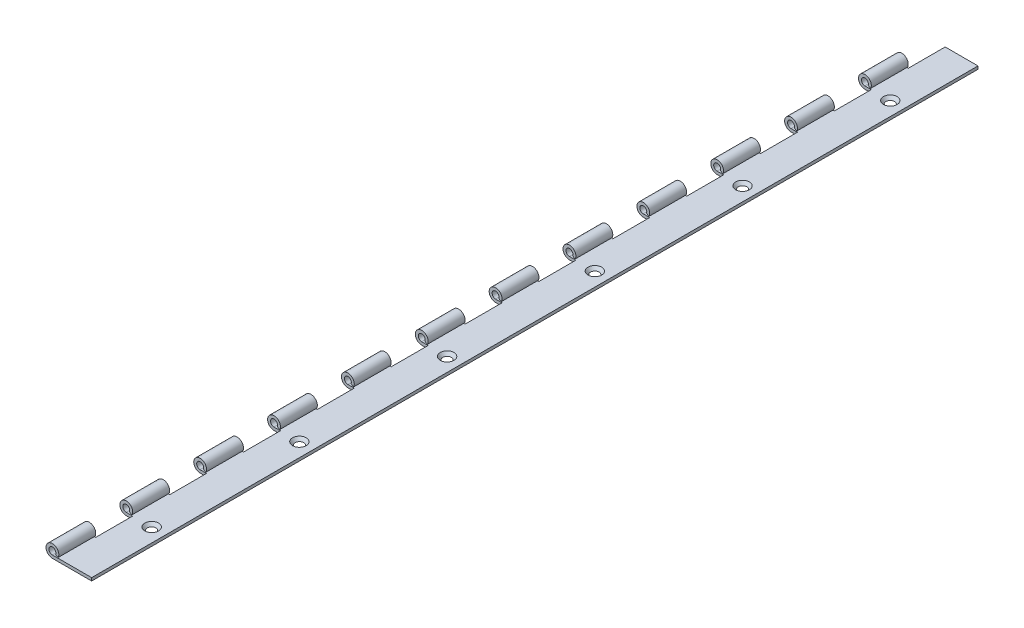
ISO-10303-21;
HEADER;
FILE_DESCRIPTION(('STEP AP214'),'2;1');
FILE_NAME('part.step','',(''),(''),'','','');
FILE_SCHEMA(('AUTOMOTIVE_DESIGN { 1 0 10303 214 1 1 1 1 }'));
ENDSEC;
DATA;
#1=APPLICATION_CONTEXT('core data for automotive mechanical design processes');
#2=APPLICATION_PROTOCOL_DEFINITION('international standard','automotive_design',2000,#1);
#3=PRODUCT_CONTEXT('',#1,'mechanical');
#4=PRODUCT('Part','Part','',(#3));
#5=PRODUCT_RELATED_PRODUCT_CATEGORY('part','',(#4));
#6=PRODUCT_DEFINITION_FORMATION('','',#4);
#7=PRODUCT_DEFINITION_CONTEXT('part definition',#1,'design');
#8=PRODUCT_DEFINITION('design','',#6,#7);
#9=PRODUCT_DEFINITION_SHAPE('','',#8);
#10=(LENGTH_UNIT() NAMED_UNIT(*) SI_UNIT(.MILLI.,.METRE.));
#11=(NAMED_UNIT(*) PLANE_ANGLE_UNIT() SI_UNIT($,.RADIAN.));
#12=(NAMED_UNIT(*) SI_UNIT($,.STERADIAN.) SOLID_ANGLE_UNIT());
#13=UNCERTAINTY_MEASURE_WITH_UNIT(LENGTH_MEASURE(1.E-05),#10,'distance_accuracy_value','');
#14=(GEOMETRIC_REPRESENTATION_CONTEXT(3) GLOBAL_UNCERTAINTY_ASSIGNED_CONTEXT((#13)) GLOBAL_UNIT_ASSIGNED_CONTEXT((#10,
#11,#12)) REPRESENTATION_CONTEXT('',''));
#15=CARTESIAN_POINT('',(0.,0.,0.));
#16=DIRECTION('',(0.,0.,1.));
#17=DIRECTION('',(1.,0.,0.));
#18=AXIS2_PLACEMENT_3D('',#15,#16,#17);
#19=CARTESIAN_POINT('',(-0.0388804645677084,-1.18999,152.4));
#20=DIRECTION('',(0.,-1.,0.));
#21=DIRECTION('',(1.,0.,0.));
#22=AXIS2_PLACEMENT_3D('',#19,#20,#21);
#23=PLANE('',#22);
#24=CARTESIAN_POINT('',(8.73125,-1.18999,76.2));
#25=DIRECTION('',(0.,-1.,0.));
#26=DIRECTION('',(1.,0.,0.));
#27=AXIS2_PLACEMENT_3D('',#24,#25,#26);
#28=CIRCLE('',#27,2.35639532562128);
#29=CARTESIAN_POINT('',(11.0876453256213,-1.18999,76.2));
#30=VERTEX_POINT('',#29);
#31=EDGE_CURVE('E1060',#30,#30,#28,.F.);
#32=ORIENTED_EDGE('',*,*,#31,.F.);
#33=EDGE_LOOP('',(#32));
#34=FACE_BOUND('',#33,.T.);
#35=CARTESIAN_POINT('',(8.73125,-1.18999,-25.4));
#36=DIRECTION('',(0.,-1.,0.));
#37=DIRECTION('',(1.,0.,0.));
#38=AXIS2_PLACEMENT_3D('',#35,#36,#37);
#39=CIRCLE('',#38,2.35639532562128);
#40=CARTESIAN_POINT('',(11.0876453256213,-1.18999,-25.4));
#41=VERTEX_POINT('',#40);
#42=EDGE_CURVE('E1048',#41,#41,#39,.F.);
#43=ORIENTED_EDGE('',*,*,#42,.F.);
#44=EDGE_LOOP('',(#43));
#45=FACE_BOUND('',#44,.T.);
#46=CARTESIAN_POINT('',(8.73125,-1.18999,-127.));
#47=DIRECTION('',(0.,-1.,0.));
#48=DIRECTION('',(1.,0.,0.));
#49=AXIS2_PLACEMENT_3D('',#46,#47,#48);
#50=CIRCLE('',#49,2.35639532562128);
#51=CARTESIAN_POINT('',(11.0876453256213,-1.18999,-127.));
#52=VERTEX_POINT('',#51);
#53=EDGE_CURVE('E511',#52,#52,#50,.F.);
#54=ORIENTED_EDGE('',*,*,#53,.F.);
#55=EDGE_LOOP('',(#54));
#56=FACE_BOUND('',#55,.T.);
#57=DIRECTION('',(0.,0.,-1.));
#58=VECTOR('',#57,1.);
#59=CARTESIAN_POINT('',(-0.0388804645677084,-1.18999,152.4));
#60=LINE('',#59,#58);
#61=CARTESIAN_POINT('',(-0.0388804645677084,-1.18999,127.));
#62=VERTEX_POINT('',#61);
#63=CARTESIAN_POINT('',(-0.0388804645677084,-1.18999,114.3));
#64=VERTEX_POINT('',#63);
#65=EDGE_CURVE('E913',#62,#64,#60,.T.);
#66=ORIENTED_EDGE('',*,*,#65,.F.);
#67=DIRECTION('',(1.,0.,0.));
#68=VECTOR('',#67,1.);
#69=CARTESIAN_POINT('',(-0.0388804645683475,-1.18999,127.));
#70=LINE('',#69,#68);
#71=CARTESIAN_POINT('',(2.20599000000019,-1.18999,127.));
#72=VERTEX_POINT('',#71);
#73=EDGE_CURVE('E516',#62,#72,#70,.T.);
#74=ORIENTED_EDGE('',*,*,#73,.T.);
#75=DIRECTION('',(0.,0.,1.));
#76=VECTOR('',#75,1.);
#77=CARTESIAN_POINT('',(2.20599000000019,-1.18999,152.4));
#78=LINE('',#77,#76);
#79=CARTESIAN_POINT('',(2.20599000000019,-1.18999,139.7));
#80=VERTEX_POINT('',#79);
#81=EDGE_CURVE('E502',#72,#80,#78,.T.);
#82=ORIENTED_EDGE('',*,*,#81,.T.);
#83=DIRECTION('',(-1.,0.,0.));
#84=VECTOR('',#83,1.);
#85=CARTESIAN_POINT('',(-0.0388804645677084,-1.18999,139.7));
#86=LINE('',#85,#84);
#87=CARTESIAN_POINT('',(-0.0388804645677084,-1.18999,139.7));
#88=VERTEX_POINT('',#87);
#89=EDGE_CURVE('E494',#80,#88,#86,.T.);
#90=ORIENTED_EDGE('',*,*,#89,.T.);
#91=CARTESIAN_POINT('',(-0.0388804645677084,-1.18999,152.4));
#92=VERTEX_POINT('',#91);
#93=EDGE_CURVE('E910',#92,#88,#60,.T.);
#94=ORIENTED_EDGE('',*,*,#93,.F.);
#95=DIRECTION('',(-1.,0.,0.));
#96=VECTOR('',#95,1.);
#97=CARTESIAN_POINT('',(-0.0388804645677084,-1.18999,152.4));
#98=LINE('',#97,#96);
#99=CARTESIAN_POINT('',(13.49375,-1.18999,152.4));
#100=VERTEX_POINT('',#99);
#101=EDGE_CURVE('E869',#100,#92,#98,.T.);
#102=ORIENTED_EDGE('',*,*,#101,.F.);
#103=DIRECTION('',(0.,0.,-1.));
#104=VECTOR('',#103,1.);
#105=CARTESIAN_POINT('',(13.49375,-1.18999,152.4));
#106=LINE('',#105,#104);
#107=CARTESIAN_POINT('',(13.49375,-1.18999,-152.4));
#108=VERTEX_POINT('',#107);
#109=EDGE_CURVE('E883',#100,#108,#106,.T.);
#110=ORIENTED_EDGE('',*,*,#109,.T.);
#111=DIRECTION('',(-1.,0.,0.));
#112=VECTOR('',#111,1.);
#113=CARTESIAN_POINT('',(-0.0388804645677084,-1.18999,-152.4));
#114=LINE('',#113,#112);
#115=CARTESIAN_POINT('',(2.20599000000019,-1.18999,-152.4));
#116=VERTEX_POINT('',#115);
#117=EDGE_CURVE('E868',#108,#116,#114,.T.);
#118=ORIENTED_EDGE('',*,*,#117,.T.);
#119=DIRECTION('',(0.,0.,1.));
#120=VECTOR('',#119,1.);
#121=CARTESIAN_POINT('',(2.20599000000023,-1.18999,152.4));
#122=LINE('',#121,#120);
#123=CARTESIAN_POINT('',(2.20599000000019,-1.18999,-139.7));
#124=VERTEX_POINT('',#123);
#125=EDGE_CURVE('E853',#116,#124,#122,.T.);
#126=ORIENTED_EDGE('',*,*,#125,.T.);
#127=DIRECTION('',(-1.,0.,0.));
#128=VECTOR('',#127,1.);
#129=CARTESIAN_POINT('',(-0.0388804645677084,-1.18999,-139.7));
#130=LINE('',#129,#128);
#131=CARTESIAN_POINT('',(-0.0388804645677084,-1.18999,-139.7));
#132=VERTEX_POINT('',#131);
#133=EDGE_CURVE('E865',#124,#132,#130,.T.);
#134=ORIENTED_EDGE('',*,*,#133,.T.);
#135=CARTESIAN_POINT('',(-0.0388804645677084,-1.18999,-127.));
#136=VERTEX_POINT('',#135);
#137=EDGE_CURVE('E908',#136,#132,#60,.T.);
#138=ORIENTED_EDGE('',*,*,#137,.F.);
#139=DIRECTION('',(1.,0.,0.));
#140=VECTOR('',#139,1.);
#141=CARTESIAN_POINT('',(-0.0388804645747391,-1.18999,-127.));
#142=LINE('',#141,#140);
#143=CARTESIAN_POINT('',(2.20599000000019,-1.18999,-127.));
#144=VERTEX_POINT('',#143);
#145=EDGE_CURVE('E844',#136,#144,#142,.T.);
#146=ORIENTED_EDGE('',*,*,#145,.T.);
#147=DIRECTION('',(0.,0.,1.));
#148=VECTOR('',#147,1.);
#149=CARTESIAN_POINT('',(2.20599000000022,-1.18999,152.4));
#150=LINE('',#149,#148);
#151=CARTESIAN_POINT('',(2.20599000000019,-1.18999,-114.3));
#152=VERTEX_POINT('',#151);
#153=EDGE_CURVE('E833',#144,#152,#150,.T.);
#154=ORIENTED_EDGE('',*,*,#153,.T.);
#155=DIRECTION('',(-1.,0.,0.));
#156=VECTOR('',#155,1.);
#157=CARTESIAN_POINT('',(-0.0388804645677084,-1.18999,-114.3));
#158=LINE('',#157,#156);
#159=CARTESIAN_POINT('',(-0.0388804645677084,-1.18999,-114.3));
#160=VERTEX_POINT('',#159);
#161=EDGE_CURVE('E830',#152,#160,#158,.T.);
#162=ORIENTED_EDGE('',*,*,#161,.T.);
#163=CARTESIAN_POINT('',(-0.0388804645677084,-1.18999,-101.6));
#164=VERTEX_POINT('',#163);
#165=EDGE_CURVE('E1413',#164,#160,#60,.T.);
#166=ORIENTED_EDGE('',*,*,#165,.F.);
#167=DIRECTION('',(1.,0.,0.));
#168=VECTOR('',#167,1.);
#169=CARTESIAN_POINT('',(-0.0388804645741,-1.18999,-101.6));
#170=LINE('',#169,#168);
#171=CARTESIAN_POINT('',(2.20599000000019,-1.18999,-101.6));
#172=VERTEX_POINT('',#171);
#173=EDGE_CURVE('E812',#164,#172,#170,.T.);
#174=ORIENTED_EDGE('',*,*,#173,.T.);
#175=DIRECTION('',(0.,0.,1.));
#176=VECTOR('',#175,1.);
#177=CARTESIAN_POINT('',(2.20599000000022,-1.18999,152.4));
#178=LINE('',#177,#176);
#179=CARTESIAN_POINT('',(2.20599000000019,-1.18999,-88.8999999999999));
#180=VERTEX_POINT('',#179);
#181=EDGE_CURVE('E801',#172,#180,#178,.T.);
#182=ORIENTED_EDGE('',*,*,#181,.T.);
#183=DIRECTION('',(-1.,0.,0.));
#184=VECTOR('',#183,1.);
#185=CARTESIAN_POINT('',(-0.0388804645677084,-1.18999,-88.8999999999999));
#186=LINE('',#185,#184);
#187=CARTESIAN_POINT('',(-0.0388804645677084,-1.18999,-88.8999999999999));
#188=VERTEX_POINT('',#187);
#189=EDGE_CURVE('E798',#180,#188,#186,.T.);
#190=ORIENTED_EDGE('',*,*,#189,.T.);
#191=CARTESIAN_POINT('',(-0.0388804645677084,-1.18999,-76.2));
#192=VERTEX_POINT('',#191);
#193=EDGE_CURVE('E1414',#192,#188,#60,.T.);
#194=ORIENTED_EDGE('',*,*,#193,.F.);
#195=DIRECTION('',(1.,0.,0.));
#196=VECTOR('',#195,1.);
#197=CARTESIAN_POINT('',(-0.0388804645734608,-1.18999,-76.2));
#198=LINE('',#197,#196);
#199=CARTESIAN_POINT('',(2.20599000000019,-1.18999,-76.2000000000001));
#200=VERTEX_POINT('',#199);
#201=EDGE_CURVE('E780',#192,#200,#198,.T.);
#202=ORIENTED_EDGE('',*,*,#201,.T.);
#203=DIRECTION('',(0.,0.,1.));
#204=VECTOR('',#203,1.);
#205=CARTESIAN_POINT('',(2.20599000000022,-1.18999,152.4));
#206=LINE('',#205,#204);
#207=CARTESIAN_POINT('',(2.20599000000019,-1.18999,-63.4999999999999));
#208=VERTEX_POINT('',#207);
#209=EDGE_CURVE('E769',#200,#208,#206,.T.);
#210=ORIENTED_EDGE('',*,*,#209,.T.);
#211=DIRECTION('',(-1.,0.,0.));
#212=VECTOR('',#211,1.);
#213=CARTESIAN_POINT('',(-0.0388804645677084,-1.18999,-63.4999999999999));
#214=LINE('',#213,#212);
#215=CARTESIAN_POINT('',(-0.0388804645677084,-1.18999,-63.4999999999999));
#216=VERTEX_POINT('',#215);
#217=EDGE_CURVE('E766',#208,#216,#214,.T.);
#218=ORIENTED_EDGE('',*,*,#217,.T.);
#219=CARTESIAN_POINT('',(-0.0388804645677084,-1.18999,-50.8));
#220=VERTEX_POINT('',#219);
#221=EDGE_CURVE('E1417',#220,#216,#60,.T.);
#222=ORIENTED_EDGE('',*,*,#221,.F.);
#223=DIRECTION('',(1.,0.,0.));
#224=VECTOR('',#223,1.);
#225=CARTESIAN_POINT('',(-0.0388804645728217,-1.18999,-50.8));
#226=LINE('',#225,#224);
#227=CARTESIAN_POINT('',(2.20599000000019,-1.18999,-50.8000000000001));
#228=VERTEX_POINT('',#227);
#229=EDGE_CURVE('E748',#220,#228,#226,.T.);
#230=ORIENTED_EDGE('',*,*,#229,.T.);
#231=DIRECTION('',(0.,0.,1.));
#232=VECTOR('',#231,1.);
#233=CARTESIAN_POINT('',(2.20599000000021,-1.18999,152.4));
#234=LINE('',#233,#232);
#235=CARTESIAN_POINT('',(2.20599000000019,-1.18999,-38.0999999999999));
#236=VERTEX_POINT('',#235);
#237=EDGE_CURVE('E737',#228,#236,#234,.T.);
#238=ORIENTED_EDGE('',*,*,#237,.T.);
#239=DIRECTION('',(-1.,0.,0.));
#240=VECTOR('',#239,1.);
#241=CARTESIAN_POINT('',(-0.0388804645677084,-1.18999,-38.0999999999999));
#242=LINE('',#241,#240);
#243=CARTESIAN_POINT('',(-0.0388804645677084,-1.18999,-38.0999999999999));
#244=VERTEX_POINT('',#243);
#245=EDGE_CURVE('E734',#236,#244,#242,.T.);
#246=ORIENTED_EDGE('',*,*,#245,.T.);
#247=CARTESIAN_POINT('',(-0.0388804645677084,-1.18999,-25.4));
#248=VERTEX_POINT('',#247);
#249=EDGE_CURVE('E1420',#248,#244,#60,.T.);
#250=ORIENTED_EDGE('',*,*,#249,.F.);
#251=DIRECTION('',(1.,0.,0.));
#252=VECTOR('',#251,1.);
#253=CARTESIAN_POINT('',(-0.0388804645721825,-1.18999,-25.4));
#254=LINE('',#253,#252);
#255=CARTESIAN_POINT('',(2.20599000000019,-1.18999,-25.4000000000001));
#256=VERTEX_POINT('',#255);
#257=EDGE_CURVE('E716',#248,#256,#254,.T.);
#258=ORIENTED_EDGE('',*,*,#257,.T.);
#259=DIRECTION('',(0.,0.,1.));
#260=VECTOR('',#259,1.);
#261=CARTESIAN_POINT('',(2.20599000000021,-1.18999,152.4));
#262=LINE('',#261,#260);
#263=CARTESIAN_POINT('',(2.20599000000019,-1.18999,-12.6999999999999));
#264=VERTEX_POINT('',#263);
#265=EDGE_CURVE('E705',#256,#264,#262,.T.);
#266=ORIENTED_EDGE('',*,*,#265,.T.);
#267=DIRECTION('',(-1.,0.,0.));
#268=VECTOR('',#267,1.);
#269=CARTESIAN_POINT('',(-0.0388804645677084,-1.18999,-12.6999999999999));
#270=LINE('',#269,#268);
#271=CARTESIAN_POINT('',(-0.0388804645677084,-1.18999,-12.6999999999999));
#272=VERTEX_POINT('',#271);
#273=EDGE_CURVE('E702',#264,#272,#270,.T.);
#274=ORIENTED_EDGE('',*,*,#273,.T.);
#275=CARTESIAN_POINT('',(-0.0388804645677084,-1.18999,0.));
#276=VERTEX_POINT('',#275);
#277=EDGE_CURVE('E1423',#276,#272,#60,.T.);
#278=ORIENTED_EDGE('',*,*,#277,.F.);
#279=DIRECTION('',(1.,0.,0.));
#280=VECTOR('',#279,1.);
#281=CARTESIAN_POINT('',(-0.0388804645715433,-1.18999,0.));
#282=LINE('',#281,#280);
#283=CARTESIAN_POINT('',(2.20599000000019,-1.18999,-1.11022302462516E-13));
#284=VERTEX_POINT('',#283);
#285=EDGE_CURVE('E684',#276,#284,#282,.T.);
#286=ORIENTED_EDGE('',*,*,#285,.T.);
#287=DIRECTION('',(0.,0.,1.));
#288=VECTOR('',#287,1.);
#289=CARTESIAN_POINT('',(2.20599000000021,-1.18999,152.4));
#290=LINE('',#289,#288);
#291=CARTESIAN_POINT('',(2.20599000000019,-1.18999,12.7));
#292=VERTEX_POINT('',#291);
#293=EDGE_CURVE('E673',#284,#292,#290,.T.);
#294=ORIENTED_EDGE('',*,*,#293,.T.);
#295=DIRECTION('',(-1.,0.,0.));
#296=VECTOR('',#295,1.);
#297=CARTESIAN_POINT('',(-0.0388804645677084,-1.18999,12.7));
#298=LINE('',#297,#296);
#299=CARTESIAN_POINT('',(-0.0388804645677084,-1.18999,12.7));
#300=VERTEX_POINT('',#299);
#301=EDGE_CURVE('E670',#292,#300,#298,.T.);
#302=ORIENTED_EDGE('',*,*,#301,.T.);
#303=CARTESIAN_POINT('',(-0.0388804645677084,-1.18999,25.3999999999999));
#304=VERTEX_POINT('',#303);
#305=EDGE_CURVE('E1426',#304,#300,#60,.T.);
#306=ORIENTED_EDGE('',*,*,#305,.F.);
#307=DIRECTION('',(1.,0.,0.));
#308=VECTOR('',#307,1.);
#309=CARTESIAN_POINT('',(-0.0388804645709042,-1.18999,25.3999999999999));
#310=LINE('',#309,#308);
#311=CARTESIAN_POINT('',(2.20599000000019,-1.18999,25.3999999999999));
#312=VERTEX_POINT('',#311);
#313=EDGE_CURVE('E652',#304,#312,#310,.T.);
#314=ORIENTED_EDGE('',*,*,#313,.T.);
#315=DIRECTION('',(0.,0.,1.));
#316=VECTOR('',#315,1.);
#317=CARTESIAN_POINT('',(2.2059900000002,-1.18999,152.4));
#318=LINE('',#317,#316);
#319=CARTESIAN_POINT('',(2.20599000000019,-1.18999,38.1000000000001));
#320=VERTEX_POINT('',#319);
#321=EDGE_CURVE('E641',#312,#320,#318,.T.);
#322=ORIENTED_EDGE('',*,*,#321,.T.);
#323=DIRECTION('',(-1.,0.,0.));
#324=VECTOR('',#323,1.);
#325=CARTESIAN_POINT('',(-0.0388804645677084,-1.18999,38.1000000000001));
#326=LINE('',#325,#324);
#327=CARTESIAN_POINT('',(-0.0388804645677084,-1.18999,38.1000000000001));
#328=VERTEX_POINT('',#327);
#329=EDGE_CURVE('E638',#320,#328,#326,.T.);
#330=ORIENTED_EDGE('',*,*,#329,.T.);
#331=CARTESIAN_POINT('',(-0.0388804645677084,-1.18999,50.8));
#332=VERTEX_POINT('',#331);
#333=EDGE_CURVE('E1429',#332,#328,#60,.T.);
#334=ORIENTED_EDGE('',*,*,#333,.F.);
#335=DIRECTION('',(1.,0.,0.));
#336=VECTOR('',#335,1.);
#337=CARTESIAN_POINT('',(-0.038880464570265,-1.18999,50.8));
#338=LINE('',#337,#336);
#339=CARTESIAN_POINT('',(2.20599000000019,-1.18999,50.7999999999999));
#340=VERTEX_POINT('',#339);
#341=EDGE_CURVE('E620',#332,#340,#338,.T.);
#342=ORIENTED_EDGE('',*,*,#341,.T.);
#343=DIRECTION('',(0.,0.,1.));
#344=VECTOR('',#343,1.);
#345=CARTESIAN_POINT('',(2.2059900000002,-1.18999,152.4));
#346=LINE('',#345,#344);
#347=CARTESIAN_POINT('',(2.20599000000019,-1.18999,63.5000000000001));
#348=VERTEX_POINT('',#347);
#349=EDGE_CURVE('E609',#340,#348,#346,.T.);
#350=ORIENTED_EDGE('',*,*,#349,.T.);
#351=DIRECTION('',(-1.,0.,0.));
#352=VECTOR('',#351,1.);
#353=CARTESIAN_POINT('',(-0.0388804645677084,-1.18999,63.5000000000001));
#354=LINE('',#353,#352);
#355=CARTESIAN_POINT('',(-0.0388804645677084,-1.18999,63.5000000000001));
#356=VERTEX_POINT('',#355);
#357=EDGE_CURVE('E606',#348,#356,#354,.T.);
#358=ORIENTED_EDGE('',*,*,#357,.T.);
#359=CARTESIAN_POINT('',(-0.0388804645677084,-1.18999,76.2));
#360=VERTEX_POINT('',#359);
#361=EDGE_CURVE('E1432',#360,#356,#60,.T.);
#362=ORIENTED_EDGE('',*,*,#361,.F.);
#363=DIRECTION('',(1.,0.,0.));
#364=VECTOR('',#363,1.);
#365=CARTESIAN_POINT('',(-0.0388804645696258,-1.18999,76.2));
#366=LINE('',#365,#364);
#367=CARTESIAN_POINT('',(2.20599000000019,-1.18999,76.1999999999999));
#368=VERTEX_POINT('',#367);
#369=EDGE_CURVE('E588',#360,#368,#366,.T.);
#370=ORIENTED_EDGE('',*,*,#369,.T.);
#371=DIRECTION('',(0.,0.,1.));
#372=VECTOR('',#371,1.);
#373=CARTESIAN_POINT('',(2.2059900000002,-1.18999,152.4));
#374=LINE('',#373,#372);
#375=CARTESIAN_POINT('',(2.20599000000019,-1.18999,88.9000000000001));
#376=VERTEX_POINT('',#375);
#377=EDGE_CURVE('E577',#368,#376,#374,.T.);
#378=ORIENTED_EDGE('',*,*,#377,.T.);
#379=DIRECTION('',(-1.,0.,0.));
#380=VECTOR('',#379,1.);
#381=CARTESIAN_POINT('',(-0.0388804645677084,-1.18999,88.9000000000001));
#382=LINE('',#381,#380);
#383=CARTESIAN_POINT('',(-0.0388804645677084,-1.18999,88.9000000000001));
#384=VERTEX_POINT('',#383);
#385=EDGE_CURVE('E574',#376,#384,#382,.T.);
#386=ORIENTED_EDGE('',*,*,#385,.T.);
#387=CARTESIAN_POINT('',(-0.0388804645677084,-1.18999,101.6));
#388=VERTEX_POINT('',#387);
#389=EDGE_CURVE('E1435',#388,#384,#60,.T.);
#390=ORIENTED_EDGE('',*,*,#389,.F.);
#391=DIRECTION('',(1.,0.,0.));
#392=VECTOR('',#391,1.);
#393=CARTESIAN_POINT('',(-0.0388804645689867,-1.18999,101.6));
#394=LINE('',#393,#392);
#395=CARTESIAN_POINT('',(2.20599000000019,-1.18999,101.6));
#396=VERTEX_POINT('',#395);
#397=EDGE_CURVE('E556',#388,#396,#394,.T.);
#398=ORIENTED_EDGE('',*,*,#397,.T.);
#399=DIRECTION('',(0.,0.,1.));
#400=VECTOR('',#399,1.);
#401=CARTESIAN_POINT('',(2.20599000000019,-1.18999,152.4));
#402=LINE('',#401,#400);
#403=CARTESIAN_POINT('',(2.20599000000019,-1.18999,114.3));
#404=VERTEX_POINT('',#403);
#405=EDGE_CURVE('E545',#396,#404,#402,.T.);
#406=ORIENTED_EDGE('',*,*,#405,.T.);
#407=DIRECTION('',(-1.,0.,0.));
#408=VECTOR('',#407,1.);
#409=CARTESIAN_POINT('',(-0.0388804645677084,-1.18999,114.3));
#410=LINE('',#409,#408);
#411=EDGE_CURVE('E542',#404,#64,#410,.T.);
#412=ORIENTED_EDGE('',*,*,#411,.T.);
#413=EDGE_LOOP('',(#66,#74,#82,#90,#94,#102,#110,#118,#126,#134,#138,#146,#154,#162,#166,#174,
#182,#190,#194,#202,#210,#218,#222,#230,#238,#246,#250,#258,#266,#274,#278,#286,#294,#302,#306,
#314,#322,#330,#334,#342,#350,#358,#362,#370,#378,#386,#390,#398,#406,#412));
#414=FACE_BOUND('',#413,.T.);
#415=CARTESIAN_POINT('',(8.73125,-1.18999,-76.2));
#416=DIRECTION('',(0.,-1.,0.));
#417=DIRECTION('',(1.,0.,0.));
#418=AXIS2_PLACEMENT_3D('',#415,#416,#417);
#419=CIRCLE('',#418,2.35639532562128);
#420=CARTESIAN_POINT('',(11.0876453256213,-1.18999,-76.2));
#421=VERTEX_POINT('',#420);
#422=EDGE_CURVE('E1042',#421,#421,#419,.F.);
#423=ORIENTED_EDGE('',*,*,#422,.F.);
#424=EDGE_LOOP('',(#423));
#425=FACE_BOUND('',#424,.T.);
#426=CARTESIAN_POINT('',(8.73125,-1.18999,25.4));
#427=DIRECTION('',(0.,-1.,0.));
#428=DIRECTION('',(1.,0.,0.));
#429=AXIS2_PLACEMENT_3D('',#426,#427,#428);
#430=CIRCLE('',#429,2.35639532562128);
#431=CARTESIAN_POINT('',(11.0876453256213,-1.18999,25.4));
#432=VERTEX_POINT('',#431);
#433=EDGE_CURVE('E1054',#432,#432,#430,.F.);
#434=ORIENTED_EDGE('',*,*,#433,.F.);
#435=EDGE_LOOP('',(#434));
#436=FACE_BOUND('',#435,.T.);
#437=CARTESIAN_POINT('',(8.73125,-1.18999,127.));
#438=DIRECTION('',(0.,-1.,0.));
#439=DIRECTION('',(1.,0.,0.));
#440=AXIS2_PLACEMENT_3D('',#437,#438,#439);
#441=CIRCLE('',#440,2.35639532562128);
#442=CARTESIAN_POINT('',(11.0876453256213,-1.18999,127.));
#443=VERTEX_POINT('',#442);
#444=EDGE_CURVE('E1066',#443,#443,#441,.F.);
#445=ORIENTED_EDGE('',*,*,#444,.F.);
#446=EDGE_LOOP('',(#445));
#447=FACE_BOUND('',#446,.T.);
#448=ADVANCED_FACE('F34',(#34,#45,#56,#414,#425,#436,#447),#23,.F.);
#449=CARTESIAN_POINT('',(13.49375,-2.20599,152.4));
#450=DIRECTION('',(0.,1.,0.));
#451=DIRECTION('',(-1.,0.,0.));
#452=AXIS2_PLACEMENT_3D('',#449,#450,#451);
#453=PLANE('',#452);
#454=CARTESIAN_POINT('',(8.73125,-2.20599,76.2));
#455=DIRECTION('',(0.,1.,0.));
#456=DIRECTION('',(-1.,0.,0.));
#457=AXIS2_PLACEMENT_3D('',#454,#455,#456);
#458=CIRCLE('',#457,1.47319999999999);
#459=CARTESIAN_POINT('',(7.25805,-2.20599,76.2));
#460=VERTEX_POINT('',#459);
#461=EDGE_CURVE('E1063',#460,#460,#458,.T.);
#462=ORIENTED_EDGE('',*,*,#461,.T.);
#463=EDGE_LOOP('',(#462));
#464=FACE_BOUND('',#463,.T.);
#465=CARTESIAN_POINT('',(8.73125,-2.20599,-25.4));
#466=DIRECTION('',(0.,1.,0.));
#467=DIRECTION('',(-1.,0.,0.));
#468=AXIS2_PLACEMENT_3D('',#465,#466,#467);
#469=CIRCLE('',#468,1.47319999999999);
#470=CARTESIAN_POINT('',(7.25805,-2.20599,-25.4));
#471=VERTEX_POINT('',#470);
#472=EDGE_CURVE('E1051',#471,#471,#469,.T.);
#473=ORIENTED_EDGE('',*,*,#472,.T.);
#474=EDGE_LOOP('',(#473));
#475=FACE_BOUND('',#474,.T.);
#476=CARTESIAN_POINT('',(8.73125,-2.20599,-127.));
#477=DIRECTION('',(0.,1.,0.));
#478=DIRECTION('',(-1.,0.,0.));
#479=AXIS2_PLACEMENT_3D('',#476,#477,#478);
#480=CIRCLE('',#479,1.47319999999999);
#481=CARTESIAN_POINT('',(7.25805,-2.20599,-127.));
#482=VERTEX_POINT('',#481);
#483=EDGE_CURVE('E1039',#482,#482,#480,.T.);
#484=ORIENTED_EDGE('',*,*,#483,.T.);
#485=EDGE_LOOP('',(#484));
#486=FACE_BOUND('',#485,.T.);
#487=DIRECTION('',(0.,0.,-1.));
#488=VECTOR('',#487,1.);
#489=CARTESIAN_POINT('',(2.20599000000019,-2.20599,152.4));
#490=LINE('',#489,#488);
#491=CARTESIAN_POINT('',(2.20599000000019,-2.20599,139.7));
#492=VERTEX_POINT('',#491);
#493=CARTESIAN_POINT('',(2.20599000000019,-2.20599,127.));
#494=VERTEX_POINT('',#493);
#495=EDGE_CURVE('E41',#492,#494,#490,.T.);
#496=ORIENTED_EDGE('',*,*,#495,.T.);
#497=DIRECTION('',(-1.,0.,0.));
#498=VECTOR('',#497,1.);
#499=CARTESIAN_POINT('',(13.4937499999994,-2.20599,127.));
#500=LINE('',#499,#498);
#501=CARTESIAN_POINT('',(0.,-2.20599,127.));
#502=VERTEX_POINT('',#501);
#503=EDGE_CURVE('E11',#494,#502,#500,.T.);
#504=ORIENTED_EDGE('',*,*,#503,.T.);
#505=DIRECTION('',(0.,0.,-1.));
#506=VECTOR('',#505,1.);
#507=CARTESIAN_POINT('',(0.,-2.20599,152.4));
#508=LINE('',#507,#506);
#509=CARTESIAN_POINT('',(0.,-2.20599,114.3));
#510=VERTEX_POINT('',#509);
#511=EDGE_CURVE('E899',#502,#510,#508,.T.);
#512=ORIENTED_EDGE('',*,*,#511,.T.);
#513=DIRECTION('',(1.,0.,0.));
#514=VECTOR('',#513,1.);
#515=CARTESIAN_POINT('',(13.49375,-2.20599,114.3));
#516=LINE('',#515,#514);
#517=CARTESIAN_POINT('',(2.20599000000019,-2.20599,114.3));
#518=VERTEX_POINT('',#517);
#519=EDGE_CURVE('E1000',#510,#518,#516,.T.);
#520=ORIENTED_EDGE('',*,*,#519,.T.);
#521=DIRECTION('',(0.,0.,-1.));
#522=VECTOR('',#521,1.);
#523=CARTESIAN_POINT('',(2.20599000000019,-2.20599,152.4));
#524=LINE('',#523,#522);
#525=CARTESIAN_POINT('',(2.20599000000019,-2.20599,101.6));
#526=VERTEX_POINT('',#525);
#527=EDGE_CURVE('E1003',#518,#526,#524,.T.);
#528=ORIENTED_EDGE('',*,*,#527,.T.);
#529=DIRECTION('',(-1.,0.,0.));
#530=VECTOR('',#529,1.);
#531=CARTESIAN_POINT('',(13.4937499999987,-2.20599,101.6));
#532=LINE('',#531,#530);
#533=CARTESIAN_POINT('',(0.,-2.20599,101.6));
#534=VERTEX_POINT('',#533);
#535=EDGE_CURVE('E1006',#526,#534,#532,.T.);
#536=ORIENTED_EDGE('',*,*,#535,.T.);
#537=CARTESIAN_POINT('',(0.,-2.20599,88.9000000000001));
#538=VERTEX_POINT('',#537);
#539=EDGE_CURVE('E1445',#534,#538,#508,.T.);
#540=ORIENTED_EDGE('',*,*,#539,.T.);
#541=DIRECTION('',(1.,0.,0.));
#542=VECTOR('',#541,1.);
#543=CARTESIAN_POINT('',(13.49375,-2.20599,88.9000000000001));
#544=LINE('',#543,#542);
#545=CARTESIAN_POINT('',(2.20599000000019,-2.20599,88.9000000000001));
#546=VERTEX_POINT('',#545);
#547=EDGE_CURVE('E991',#538,#546,#544,.T.);
#548=ORIENTED_EDGE('',*,*,#547,.T.);
#549=DIRECTION('',(0.,0.,-1.));
#550=VECTOR('',#549,1.);
#551=CARTESIAN_POINT('',(2.2059900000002,-2.20599,152.4));
#552=LINE('',#551,#550);
#553=CARTESIAN_POINT('',(2.20599000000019,-2.20599,76.1999999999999));
#554=VERTEX_POINT('',#553);
#555=EDGE_CURVE('E994',#546,#554,#552,.T.);
#556=ORIENTED_EDGE('',*,*,#555,.T.);
#557=DIRECTION('',(-1.,0.,0.));
#558=VECTOR('',#557,1.);
#559=CARTESIAN_POINT('',(13.4937499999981,-2.20599,76.1999999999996));
#560=LINE('',#559,#558);
#561=CARTESIAN_POINT('',(0.,-2.20599,76.2));
#562=VERTEX_POINT('',#561);
#563=EDGE_CURVE('E997',#554,#562,#560,.T.);
#564=ORIENTED_EDGE('',*,*,#563,.T.);
#565=CARTESIAN_POINT('',(0.,-2.20599,63.5000000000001));
#566=VERTEX_POINT('',#565);
#567=EDGE_CURVE('E1448',#562,#566,#508,.T.);
#568=ORIENTED_EDGE('',*,*,#567,.T.);
#569=DIRECTION('',(1.,0.,0.));
#570=VECTOR('',#569,1.);
#571=CARTESIAN_POINT('',(13.49375,-2.20599,63.5000000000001));
#572=LINE('',#571,#570);
#573=CARTESIAN_POINT('',(2.20599000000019,-2.20599,63.5000000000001));
#574=VERTEX_POINT('',#573);
#575=EDGE_CURVE('E982',#566,#574,#572,.T.);
#576=ORIENTED_EDGE('',*,*,#575,.T.);
#577=DIRECTION('',(0.,0.,-1.));
#578=VECTOR('',#577,1.);
#579=CARTESIAN_POINT('',(2.2059900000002,-2.20599,152.4));
#580=LINE('',#579,#578);
#581=CARTESIAN_POINT('',(2.20599000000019,-2.20599,50.7999999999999));
#582=VERTEX_POINT('',#581);
#583=EDGE_CURVE('E985',#574,#582,#580,.T.);
#584=ORIENTED_EDGE('',*,*,#583,.T.);
#585=DIRECTION('',(-1.,0.,0.));
#586=VECTOR('',#585,1.);
#587=CARTESIAN_POINT('',(13.4937499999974,-2.20599,50.7999999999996));
#588=LINE('',#587,#586);
#589=CARTESIAN_POINT('',(0.,-2.20599,50.8));
#590=VERTEX_POINT('',#589);
#591=EDGE_CURVE('E988',#582,#590,#588,.T.);
#592=ORIENTED_EDGE('',*,*,#591,.T.);
#593=CARTESIAN_POINT('',(0.,-2.20599,38.1000000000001));
#594=VERTEX_POINT('',#593);
#595=EDGE_CURVE('E1449',#590,#594,#508,.T.);
#596=ORIENTED_EDGE('',*,*,#595,.T.);
#597=DIRECTION('',(1.,0.,0.));
#598=VECTOR('',#597,1.);
#599=CARTESIAN_POINT('',(13.49375,-2.20599,38.1000000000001));
#600=LINE('',#599,#598);
#601=CARTESIAN_POINT('',(2.20599000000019,-2.20599,38.1000000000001));
#602=VERTEX_POINT('',#601);
#603=EDGE_CURVE('E973',#594,#602,#600,.T.);
#604=ORIENTED_EDGE('',*,*,#603,.T.);
#605=DIRECTION('',(0.,0.,-1.));
#606=VECTOR('',#605,1.);
#607=CARTESIAN_POINT('',(2.2059900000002,-2.20599,152.4));
#608=LINE('',#607,#606);
#609=CARTESIAN_POINT('',(2.20599000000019,-2.20599,25.3999999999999));
#610=VERTEX_POINT('',#609);
#611=EDGE_CURVE('E976',#602,#610,#608,.T.);
#612=ORIENTED_EDGE('',*,*,#611,.T.);
#613=DIRECTION('',(-1.,0.,0.));
#614=VECTOR('',#613,1.);
#615=CARTESIAN_POINT('',(13.4937499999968,-2.20599,25.3999999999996));
#616=LINE('',#615,#614);
#617=CARTESIAN_POINT('',(0.,-2.20599,25.4));
#618=VERTEX_POINT('',#617);
#619=EDGE_CURVE('E979',#610,#618,#616,.T.);
#620=ORIENTED_EDGE('',*,*,#619,.T.);
#621=CARTESIAN_POINT('',(0.,-2.20599,12.7));
#622=VERTEX_POINT('',#621);
#623=EDGE_CURVE('E1451',#618,#622,#508,.T.);
#624=ORIENTED_EDGE('',*,*,#623,.T.);
#625=DIRECTION('',(1.,0.,0.));
#626=VECTOR('',#625,1.);
#627=CARTESIAN_POINT('',(13.49375,-2.20599,12.7));
#628=LINE('',#627,#626);
#629=CARTESIAN_POINT('',(2.20599000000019,-2.20599,12.7));
#630=VERTEX_POINT('',#629);
#631=EDGE_CURVE('E964',#622,#630,#628,.T.);
#632=ORIENTED_EDGE('',*,*,#631,.T.);
#633=DIRECTION('',(0.,0.,-1.));
#634=VECTOR('',#633,1.);
#635=CARTESIAN_POINT('',(2.20599000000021,-2.20599,152.4));
#636=LINE('',#635,#634);
#637=CARTESIAN_POINT('',(2.20599000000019,-2.20599,-1.11022302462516E-13));
#638=VERTEX_POINT('',#637);
#639=EDGE_CURVE('E967',#630,#638,#636,.T.);
#640=ORIENTED_EDGE('',*,*,#639,.T.);
#641=DIRECTION('',(-1.,0.,0.));
#642=VECTOR('',#641,1.);
#643=CARTESIAN_POINT('',(13.4937499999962,-2.20599,-3.88578058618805E-13));
#644=LINE('',#643,#642);
#645=CARTESIAN_POINT('',(0.,-2.20599,0.));
#646=VERTEX_POINT('',#645);
#647=EDGE_CURVE('E970',#638,#646,#644,.T.);
#648=ORIENTED_EDGE('',*,*,#647,.T.);
#649=CARTESIAN_POINT('',(0.,-2.20599,-12.6999999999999));
#650=VERTEX_POINT('',#649);
#651=EDGE_CURVE('E1453',#646,#650,#508,.T.);
#652=ORIENTED_EDGE('',*,*,#651,.T.);
#653=DIRECTION('',(1.,0.,0.));
#654=VECTOR('',#653,1.);
#655=CARTESIAN_POINT('',(13.49375,-2.20599,-12.6999999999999));
#656=LINE('',#655,#654);
#657=CARTESIAN_POINT('',(2.20599000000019,-2.20599,-12.6999999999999));
#658=VERTEX_POINT('',#657);
#659=EDGE_CURVE('E955',#650,#658,#656,.T.);
#660=ORIENTED_EDGE('',*,*,#659,.T.);
#661=DIRECTION('',(0.,0.,-1.));
#662=VECTOR('',#661,1.);
#663=CARTESIAN_POINT('',(2.20599000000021,-2.20599,152.4));
#664=LINE('',#663,#662);
#665=CARTESIAN_POINT('',(2.20599000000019,-2.20599,-25.4000000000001));
#666=VERTEX_POINT('',#665);
#667=EDGE_CURVE('E958',#658,#666,#664,.T.);
#668=ORIENTED_EDGE('',*,*,#667,.T.);
#669=DIRECTION('',(-1.,0.,0.));
#670=VECTOR('',#669,1.);
#671=CARTESIAN_POINT('',(13.4937499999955,-2.20599,-25.4000000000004));
#672=LINE('',#671,#670);
#673=CARTESIAN_POINT('',(0.,-2.20599,-25.4));
#674=VERTEX_POINT('',#673);
#675=EDGE_CURVE('E961',#666,#674,#672,.T.);
#676=ORIENTED_EDGE('',*,*,#675,.T.);
#677=CARTESIAN_POINT('',(0.,-2.20599,-38.0999999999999));
#678=VERTEX_POINT('',#677);
#679=EDGE_CURVE('E1455',#674,#678,#508,.T.);
#680=ORIENTED_EDGE('',*,*,#679,.T.);
#681=DIRECTION('',(1.,0.,0.));
#682=VECTOR('',#681,1.);
#683=CARTESIAN_POINT('',(13.49375,-2.20599,-38.0999999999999));
#684=LINE('',#683,#682);
#685=CARTESIAN_POINT('',(2.20599000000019,-2.20599,-38.0999999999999));
#686=VERTEX_POINT('',#685);
#687=EDGE_CURVE('E946',#678,#686,#684,.T.);
#688=ORIENTED_EDGE('',*,*,#687,.T.);
#689=DIRECTION('',(0.,0.,-1.));
#690=VECTOR('',#689,1.);
#691=CARTESIAN_POINT('',(2.20599000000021,-2.20599,152.4));
#692=LINE('',#691,#690);
#693=CARTESIAN_POINT('',(2.20599000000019,-2.20599,-50.8000000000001));
#694=VERTEX_POINT('',#693);
#695=EDGE_CURVE('E949',#686,#694,#692,.T.);
#696=ORIENTED_EDGE('',*,*,#695,.T.);
#697=DIRECTION('',(-1.,0.,0.));
#698=VECTOR('',#697,1.);
#699=CARTESIAN_POINT('',(13.4937499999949,-2.20599,-50.8000000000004));
#700=LINE('',#699,#698);
#701=CARTESIAN_POINT('',(0.,-2.20599,-50.8));
#702=VERTEX_POINT('',#701);
#703=EDGE_CURVE('E952',#694,#702,#700,.T.);
#704=ORIENTED_EDGE('',*,*,#703,.T.);
#705=CARTESIAN_POINT('',(0.,-2.20599,-63.4999999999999));
#706=VERTEX_POINT('',#705);
#707=EDGE_CURVE('E1457',#702,#706,#508,.T.);
#708=ORIENTED_EDGE('',*,*,#707,.T.);
#709=DIRECTION('',(1.,0.,0.));
#710=VECTOR('',#709,1.);
#711=CARTESIAN_POINT('',(13.49375,-2.20599,-63.4999999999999));
#712=LINE('',#711,#710);
#713=CARTESIAN_POINT('',(2.20599000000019,-2.20599,-63.4999999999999));
#714=VERTEX_POINT('',#713);
#715=EDGE_CURVE('E937',#706,#714,#712,.T.);
#716=ORIENTED_EDGE('',*,*,#715,.T.);
#717=DIRECTION('',(0.,0.,-1.));
#718=VECTOR('',#717,1.);
#719=CARTESIAN_POINT('',(2.20599000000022,-2.20599,152.4));
#720=LINE('',#719,#718);
#721=CARTESIAN_POINT('',(2.20599000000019,-2.20599,-76.2000000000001));
#722=VERTEX_POINT('',#721);
#723=EDGE_CURVE('E940',#714,#722,#720,.T.);
#724=ORIENTED_EDGE('',*,*,#723,.T.);
#725=DIRECTION('',(-1.,0.,0.));
#726=VECTOR('',#725,1.);
#727=CARTESIAN_POINT('',(13.4937499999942,-2.20599,-76.2000000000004));
#728=LINE('',#727,#726);
#729=CARTESIAN_POINT('',(0.,-2.20599,-76.2));
#730=VERTEX_POINT('',#729);
#731=EDGE_CURVE('E943',#722,#730,#728,.T.);
#732=ORIENTED_EDGE('',*,*,#731,.T.);
#733=CARTESIAN_POINT('',(0.,-2.20599,-88.8999999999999));
#734=VERTEX_POINT('',#733);
#735=EDGE_CURVE('E1459',#730,#734,#508,.T.);
#736=ORIENTED_EDGE('',*,*,#735,.T.);
#737=DIRECTION('',(1.,0.,0.));
#738=VECTOR('',#737,1.);
#739=CARTESIAN_POINT('',(13.49375,-2.20599,-88.8999999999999));
#740=LINE('',#739,#738);
#741=CARTESIAN_POINT('',(2.20599000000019,-2.20599,-88.8999999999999));
#742=VERTEX_POINT('',#741);
#743=EDGE_CURVE('E928',#734,#742,#740,.T.);
#744=ORIENTED_EDGE('',*,*,#743,.T.);
#745=DIRECTION('',(0.,0.,-1.));
#746=VECTOR('',#745,1.);
#747=CARTESIAN_POINT('',(2.20599000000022,-2.20599,152.4));
#748=LINE('',#747,#746);
#749=CARTESIAN_POINT('',(2.20599000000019,-2.20599,-101.6));
#750=VERTEX_POINT('',#749);
#751=EDGE_CURVE('E931',#742,#750,#748,.T.);
#752=ORIENTED_EDGE('',*,*,#751,.T.);
#753=DIRECTION('',(-1.,0.,0.));
#754=VECTOR('',#753,1.);
#755=CARTESIAN_POINT('',(13.4937499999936,-2.20599,-101.6));
#756=LINE('',#755,#754);
#757=CARTESIAN_POINT('',(0.,-2.20599,-101.6));
#758=VERTEX_POINT('',#757);
#759=EDGE_CURVE('E934',#750,#758,#756,.T.);
#760=ORIENTED_EDGE('',*,*,#759,.T.);
#761=CARTESIAN_POINT('',(0.,-2.20599,-114.3));
#762=VERTEX_POINT('',#761);
#763=EDGE_CURVE('E1461',#758,#762,#508,.T.);
#764=ORIENTED_EDGE('',*,*,#763,.T.);
#765=DIRECTION('',(1.,0.,0.));
#766=VECTOR('',#765,1.);
#767=CARTESIAN_POINT('',(13.49375,-2.20599,-114.3));
#768=LINE('',#767,#766);
#769=CARTESIAN_POINT('',(2.20599000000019,-2.20599,-114.3));
#770=VERTEX_POINT('',#769);
#771=EDGE_CURVE('E919',#762,#770,#768,.T.);
#772=ORIENTED_EDGE('',*,*,#771,.T.);
#773=DIRECTION('',(0.,0.,-1.));
#774=VECTOR('',#773,1.);
#775=CARTESIAN_POINT('',(2.20599000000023,-2.20599,152.4));
#776=LINE('',#775,#774);
#777=CARTESIAN_POINT('',(2.20599000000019,-2.20599,-127.));
#778=VERTEX_POINT('',#777);
#779=EDGE_CURVE('E922',#770,#778,#776,.T.);
#780=ORIENTED_EDGE('',*,*,#779,.T.);
#781=DIRECTION('',(-1.,0.,0.));
#782=VECTOR('',#781,1.);
#783=CARTESIAN_POINT('',(13.493749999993,-2.20599,-127.));
#784=LINE('',#783,#782);
#785=CARTESIAN_POINT('',(0.,-2.20599,-127.));
#786=VERTEX_POINT('',#785);
#787=EDGE_CURVE('E925',#778,#786,#784,.T.);
#788=ORIENTED_EDGE('',*,*,#787,.T.);
#789=CARTESIAN_POINT('',(0.,-2.20599,-139.7));
#790=VERTEX_POINT('',#789);
#791=EDGE_CURVE('E894',#786,#790,#508,.T.);
#792=ORIENTED_EDGE('',*,*,#791,.T.);
#793=DIRECTION('',(1.,0.,0.));
#794=VECTOR('',#793,1.);
#795=CARTESIAN_POINT('',(13.49375,-2.20599,-139.7));
#796=LINE('',#795,#794);
#797=CARTESIAN_POINT('',(2.20599000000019,-2.20599,-139.7));
#798=VERTEX_POINT('',#797);
#799=EDGE_CURVE('E916',#790,#798,#796,.T.);
#800=ORIENTED_EDGE('',*,*,#799,.T.);
#801=DIRECTION('',(0.,0.,-1.));
#802=VECTOR('',#801,1.);
#803=CARTESIAN_POINT('',(2.20599000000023,-2.20599,152.4));
#804=LINE('',#803,#802);
#805=CARTESIAN_POINT('',(2.20599000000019,-2.20599,-152.4));
#806=VERTEX_POINT('',#805);
#807=EDGE_CURVE('E850',#798,#806,#804,.T.);
#808=ORIENTED_EDGE('',*,*,#807,.T.);
#809=DIRECTION('',(1.,0.,0.));
#810=VECTOR('',#809,1.);
#811=CARTESIAN_POINT('',(13.49375,-2.20599,-152.4));
#812=LINE('',#811,#810);
#813=CARTESIAN_POINT('',(13.49375,-2.20599,-152.4));
#814=VERTEX_POINT('',#813);
#815=EDGE_CURVE('E886',#806,#814,#812,.T.);
#816=ORIENTED_EDGE('',*,*,#815,.T.);
#817=DIRECTION('',(0.,0.,-1.));
#818=VECTOR('',#817,1.);
#819=CARTESIAN_POINT('',(13.49375,-2.20599,152.4));
#820=LINE('',#819,#818);
#821=CARTESIAN_POINT('',(13.49375,-2.20599,152.4));
#822=VERTEX_POINT('',#821);
#823=EDGE_CURVE('E891',#822,#814,#820,.T.);
#824=ORIENTED_EDGE('',*,*,#823,.F.);
#825=DIRECTION('',(1.,0.,0.));
#826=VECTOR('',#825,1.);
#827=CARTESIAN_POINT('',(13.49375,-2.20599,152.4));
#828=LINE('',#827,#826);
#829=CARTESIAN_POINT('',(0.,-2.20599,152.4));
#830=VERTEX_POINT('',#829);
#831=EDGE_CURVE('E879',#830,#822,#828,.T.);
#832=ORIENTED_EDGE('',*,*,#831,.F.);
#833=CARTESIAN_POINT('',(0.,-2.20599,139.7));
#834=VERTEX_POINT('',#833);
#835=EDGE_CURVE('E895',#830,#834,#508,.T.);
#836=ORIENTED_EDGE('',*,*,#835,.T.);
#837=DIRECTION('',(1.,0.,0.));
#838=VECTOR('',#837,1.);
#839=CARTESIAN_POINT('',(13.49375,-2.20599,139.7));
#840=LINE('',#839,#838);
#841=EDGE_CURVE('E1009',#834,#492,#840,.T.);
#842=ORIENTED_EDGE('',*,*,#841,.T.);
#843=EDGE_LOOP('',(#496,#504,#512,#520,#528,#536,#540,#548,#556,#564,#568,#576,#584,#592,#596,
#604,#612,#620,#624,#632,#640,#648,#652,#660,#668,#676,#680,#688,#696,#704,#708,#716,#724,#732,
#736,#744,#752,#760,#764,#772,#780,#788,#792,#800,#808,#816,#824,#832,#836,#842));
#844=FACE_BOUND('',#843,.T.);
#845=CARTESIAN_POINT('',(8.73125,-2.20599,-76.2));
#846=DIRECTION('',(0.,1.,0.));
#847=DIRECTION('',(-1.,0.,0.));
#848=AXIS2_PLACEMENT_3D('',#845,#846,#847);
#849=CIRCLE('',#848,1.47319999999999);
#850=CARTESIAN_POINT('',(7.25805,-2.20599,-76.2));
#851=VERTEX_POINT('',#850);
#852=EDGE_CURVE('E1045',#851,#851,#849,.T.);
#853=ORIENTED_EDGE('',*,*,#852,.T.);
#854=EDGE_LOOP('',(#853));
#855=FACE_BOUND('',#854,.T.);
#856=CARTESIAN_POINT('',(8.73125,-2.20599,25.4));
#857=DIRECTION('',(0.,1.,0.));
#858=DIRECTION('',(-1.,0.,0.));
#859=AXIS2_PLACEMENT_3D('',#856,#857,#858);
#860=CIRCLE('',#859,1.47319999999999);
#861=CARTESIAN_POINT('',(7.25805,-2.20599,25.4));
#862=VERTEX_POINT('',#861);
#863=EDGE_CURVE('E1057',#862,#862,#860,.T.);
#864=ORIENTED_EDGE('',*,*,#863,.T.);
#865=EDGE_LOOP('',(#864));
#866=FACE_BOUND('',#865,.T.);
#867=CARTESIAN_POINT('',(8.73125,-2.20599,127.));
#868=DIRECTION('',(0.,1.,0.));
#869=DIRECTION('',(-1.,0.,0.));
#870=AXIS2_PLACEMENT_3D('',#867,#868,#869);
#871=CIRCLE('',#870,1.47319999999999);
#872=CARTESIAN_POINT('',(7.25805,-2.20599,127.));
#873=VERTEX_POINT('',#872);
#874=EDGE_CURVE('E1069',#873,#873,#871,.T.);
#875=ORIENTED_EDGE('',*,*,#874,.T.);
#876=EDGE_LOOP('',(#875));
#877=FACE_BOUND('',#876,.T.);
#878=ADVANCED_FACE('F1011',(#464,#475,#486,#844,#855,#866,#877),#453,.F.);
#879=CARTESIAN_POINT('',(0.,0.,152.4));
#880=DIRECTION('',(0.,0.,-1.));
#881=DIRECTION('',(-1.,0.,0.));
#882=AXIS2_PLACEMENT_3D('',#879,#880,#881);
#883=CYLINDRICAL_SURFACE('',#882,2.20599);
#884=CARTESIAN_POINT('',(0.,0.,139.7));
#885=DIRECTION('',(0.,0.,1.));
#886=DIRECTION('',(1.,0.,0.));
#887=AXIS2_PLACEMENT_3D('',#884,#885,#886);
#888=CIRCLE('',#887,2.20599);
#889=CARTESIAN_POINT('',(1.99930591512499,-0.932291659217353,139.7));
#890=VERTEX_POINT('',#889);
#891=EDGE_CURVE('E1016',#890,#834,#888,.T.);
#892=ORIENTED_EDGE('',*,*,#891,.T.);
#893=ORIENTED_EDGE('',*,*,#835,.F.);
#894=CARTESIAN_POINT('',(0.,0.,152.4));
#895=DIRECTION('',(0.,0.,1.));
#896=DIRECTION('',(1.,0.,0.));
#897=AXIS2_PLACEMENT_3D('',#894,#895,#896);
#898=CIRCLE('',#897,2.20599);
#899=CARTESIAN_POINT('',(1.99930591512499,-0.932291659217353,152.4));
#900=VERTEX_POINT('',#899);
#901=EDGE_CURVE('E877',#900,#830,#898,.T.);
#902=ORIENTED_EDGE('',*,*,#901,.F.);
#903=DIRECTION('',(0.,0.,-1.));
#904=VECTOR('',#903,1.);
#905=CARTESIAN_POINT('',(1.99930591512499,-0.932291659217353,152.4));
#906=LINE('',#905,#904);
#907=EDGE_CURVE('E900',#900,#890,#906,.T.);
#908=ORIENTED_EDGE('',*,*,#907,.T.);
#909=EDGE_LOOP('',(#892,#893,#902,#908));
#910=FACE_BOUND('',#909,.T.);
#911=ADVANCED_FACE('F1028',(#910),#883,.T.);
#912=CARTESIAN_POINT('',(0.,0.,152.4));
#913=DIRECTION('',(0.,0.,-1.));
#914=DIRECTION('',(-1.,0.,0.));
#915=AXIS2_PLACEMENT_3D('',#912,#913,#914);
#916=CYLINDRICAL_SURFACE('',#915,1.190625);
#917=DIRECTION('',(0.,0.,-1.));
#918=VECTOR('',#917,1.);
#919=CARTESIAN_POINT('',(1.07907270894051,-0.503179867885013,152.4));
#920=LINE('',#919,#918);
#921=CARTESIAN_POINT('',(1.07907270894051,-0.503179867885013,127.));
#922=VERTEX_POINT('',#921);
#923=CARTESIAN_POINT('',(1.07907270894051,-0.503179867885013,114.3));
#924=VERTEX_POINT('',#923);
#925=EDGE_CURVE('E909',#922,#924,#920,.T.);
#926=ORIENTED_EDGE('',*,*,#925,.F.);
#927=CARTESIAN_POINT('',(0.,0.,127.));
#928=DIRECTION('',(0.,0.,-1.));
#929=DIRECTION('',(-1.,0.,0.));
#930=AXIS2_PLACEMENT_3D('',#927,#928,#929);
#931=CIRCLE('',#930,1.190625);
#932=EDGE_CURVE('E525',#922,#62,#931,.F.);
#933=ORIENTED_EDGE('',*,*,#932,.T.);
#934=ORIENTED_EDGE('',*,*,#65,.T.);
#935=CARTESIAN_POINT('',(0.,0.,114.3));
#936=DIRECTION('',(0.,0.,1.));
#937=DIRECTION('',(1.,0.,0.));
#938=AXIS2_PLACEMENT_3D('',#935,#936,#937);
#939=CIRCLE('',#938,1.190625);
#940=EDGE_CURVE('E539',#64,#924,#939,.F.);
#941=ORIENTED_EDGE('',*,*,#940,.T.);
#942=EDGE_LOOP('',(#926,#933,#934,#941));
#943=FACE_BOUND('',#942,.T.);
#944=ADVANCED_FACE('F1262',(#943),#916,.F.);
#945=CARTESIAN_POINT('',(1.07907270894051,-0.503179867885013,152.4));
#946=DIRECTION('',(0.422618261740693,0.906307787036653,0.));
#947=DIRECTION('',(-0.906307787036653,0.422618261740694,0.));
#948=AXIS2_PLACEMENT_3D('',#945,#946,#947);
#949=PLANE('',#948);
#950=CARTESIAN_POINT('',(1.99930591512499,-0.932291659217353,127.));
#951=VERTEX_POINT('',#950);
#952=CARTESIAN_POINT('',(1.99930591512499,-0.932291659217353,114.3));
#953=VERTEX_POINT('',#952);
#954=EDGE_CURVE('E904',#951,#953,#906,.T.);
#955=ORIENTED_EDGE('',*,*,#954,.F.);
#956=DIRECTION('',(-0.906307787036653,0.422618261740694,0.));
#957=VECTOR('',#956,1.);
#958=CARTESIAN_POINT('',(1.07907270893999,-0.503179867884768,127.));
#959=LINE('',#958,#957);
#960=EDGE_CURVE('E519',#951,#922,#959,.T.);
#961=ORIENTED_EDGE('',*,*,#960,.T.);
#962=ORIENTED_EDGE('',*,*,#925,.T.);
#963=DIRECTION('',(0.906307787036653,-0.422618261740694,0.));
#964=VECTOR('',#963,1.);
#965=CARTESIAN_POINT('',(1.07907270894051,-0.503179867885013,114.3));
#966=LINE('',#965,#964);
#967=EDGE_CURVE('E536',#924,#953,#966,.T.);
#968=ORIENTED_EDGE('',*,*,#967,.T.);
#969=EDGE_LOOP('',(#955,#961,#962,#968));
#970=FACE_BOUND('',#969,.T.);
#971=ADVANCED_FACE('F1259',(#970),#949,.F.);
#972=CARTESIAN_POINT('',(0.,0.,127.));
#973=DIRECTION('',(0.,0.,-1.));
#974=DIRECTION('',(-1.,0.,0.));
#975=AXIS2_PLACEMENT_3D('',#972,#973,#974);
#976=CIRCLE('',#975,2.20599);
#977=EDGE_CURVE('E517',#502,#951,#976,.T.);
#978=ORIENTED_EDGE('',*,*,#977,.T.);
#979=ORIENTED_EDGE('',*,*,#954,.T.);
#980=CARTESIAN_POINT('',(0.,0.,114.3));
#981=DIRECTION('',(0.,0.,1.));
#982=DIRECTION('',(1.,0.,0.));
#983=AXIS2_PLACEMENT_3D('',#980,#981,#982);
#984=CIRCLE('',#983,2.20599);
#985=EDGE_CURVE('E532',#953,#510,#984,.T.);
#986=ORIENTED_EDGE('',*,*,#985,.T.);
#987=ORIENTED_EDGE('',*,*,#511,.F.);
#988=EDGE_LOOP('',(#978,#979,#986,#987));
#989=FACE_BOUND('',#988,.T.);
#990=ADVANCED_FACE('F1374',(#989),#883,.T.);
#991=CARTESIAN_POINT('',(1.07907270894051,-0.503179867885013,101.6));
#992=VERTEX_POINT('',#991);
#993=CARTESIAN_POINT('',(1.07907270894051,-0.503179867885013,88.9000000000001));
#994=VERTEX_POINT('',#993);
#995=EDGE_CURVE('E1385',#992,#994,#920,.T.);
#996=ORIENTED_EDGE('',*,*,#995,.F.);
#997=CARTESIAN_POINT('',(0.,0.,101.6));
#998=DIRECTION('',(0.,0.,-1.));
#999=DIRECTION('',(-1.,0.,0.));
#1000=AXIS2_PLACEMENT_3D('',#997,#998,#999);
#1001=CIRCLE('',#1000,1.190625);
#1002=EDGE_CURVE('E553',#992,#388,#1001,.F.);
#1003=ORIENTED_EDGE('',*,*,#1002,.T.);
#1004=ORIENTED_EDGE('',*,*,#389,.T.);
#1005=CARTESIAN_POINT('',(0.,0.,88.9000000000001));
#1006=DIRECTION('',(0.,0.,1.));
#1007=DIRECTION('',(1.,0.,0.));
#1008=AXIS2_PLACEMENT_3D('',#1005,#1006,#1007);
#1009=CIRCLE('',#1008,1.190625);
#1010=EDGE_CURVE('E571',#384,#994,#1009,.F.);
#1011=ORIENTED_EDGE('',*,*,#1010,.T.);
#1012=EDGE_LOOP('',(#996,#1003,#1004,#1011));
#1013=FACE_BOUND('',#1012,.T.);
#1014=ADVANCED_FACE('F1271',(#1013),#916,.F.);
#1015=CARTESIAN_POINT('',(1.99930591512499,-0.932291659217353,101.6));
#1016=VERTEX_POINT('',#1015);
#1017=CARTESIAN_POINT('',(1.99930591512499,-0.932291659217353,88.9000000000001));
#1018=VERTEX_POINT('',#1017);
#1019=EDGE_CURVE('E1492',#1016,#1018,#906,.T.);
#1020=ORIENTED_EDGE('',*,*,#1019,.F.);
#1021=DIRECTION('',(-0.906307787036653,0.422618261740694,0.));
#1022=VECTOR('',#1021,1.);
#1023=CARTESIAN_POINT('',(1.07907270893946,-0.503179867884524,101.6));
#1024=LINE('',#1023,#1022);
#1025=EDGE_CURVE('E550',#1016,#992,#1024,.T.);
#1026=ORIENTED_EDGE('',*,*,#1025,.T.);
#1027=ORIENTED_EDGE('',*,*,#995,.T.);
#1028=DIRECTION('',(0.906307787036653,-0.422618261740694,0.));
#1029=VECTOR('',#1028,1.);
#1030=CARTESIAN_POINT('',(1.07907270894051,-0.503179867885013,88.9000000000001));
#1031=LINE('',#1030,#1029);
#1032=EDGE_CURVE('E568',#994,#1018,#1031,.T.);
#1033=ORIENTED_EDGE('',*,*,#1032,.T.);
#1034=EDGE_LOOP('',(#1020,#1026,#1027,#1033));
#1035=FACE_BOUND('',#1034,.T.);
#1036=ADVANCED_FACE('F1372',(#1035),#949,.F.);
#1037=CARTESIAN_POINT('',(0.,0.,101.6));
#1038=DIRECTION('',(0.,0.,-1.));
#1039=DIRECTION('',(-1.,0.,0.));
#1040=AXIS2_PLACEMENT_3D('',#1037,#1038,#1039);
#1041=CIRCLE('',#1040,2.20599);
#1042=EDGE_CURVE('E548',#534,#1016,#1041,.T.);
#1043=ORIENTED_EDGE('',*,*,#1042,.T.);
#1044=ORIENTED_EDGE('',*,*,#1019,.T.);
#1045=CARTESIAN_POINT('',(0.,0.,88.9000000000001));
#1046=DIRECTION('',(0.,0.,1.));
#1047=DIRECTION('',(1.,0.,0.));
#1048=AXIS2_PLACEMENT_3D('',#1045,#1046,#1047);
#1049=CIRCLE('',#1048,2.20599);
#1050=EDGE_CURVE('E563',#1018,#538,#1049,.T.);
#1051=ORIENTED_EDGE('',*,*,#1050,.T.);
#1052=ORIENTED_EDGE('',*,*,#539,.F.);
#1053=EDGE_LOOP('',(#1043,#1044,#1051,#1052));
#1054=FACE_BOUND('',#1053,.T.);
#1055=ADVANCED_FACE('F1363',(#1054),#883,.T.);
#1056=CARTESIAN_POINT('',(1.07907270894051,-0.503179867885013,76.1999999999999));
#1057=VERTEX_POINT('',#1056);
#1058=CARTESIAN_POINT('',(1.07907270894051,-0.503179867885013,63.5000000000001));
#1059=VERTEX_POINT('',#1058);
#1060=EDGE_CURVE('E1389',#1057,#1059,#920,.T.);
#1061=ORIENTED_EDGE('',*,*,#1060,.F.);
#1062=CARTESIAN_POINT('',(0.,0.,76.2));
#1063=DIRECTION('',(0.,0.,-1.));
#1064=DIRECTION('',(-1.,0.,0.));
#1065=AXIS2_PLACEMENT_3D('',#1062,#1063,#1064);
#1066=CIRCLE('',#1065,1.190625);
#1067=EDGE_CURVE('E585',#1057,#360,#1066,.F.);
#1068=ORIENTED_EDGE('',*,*,#1067,.T.);
#1069=ORIENTED_EDGE('',*,*,#361,.T.);
#1070=CARTESIAN_POINT('',(0.,0.,63.5000000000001));
#1071=DIRECTION('',(0.,0.,1.));
#1072=DIRECTION('',(1.,0.,0.));
#1073=AXIS2_PLACEMENT_3D('',#1070,#1071,#1072);
#1074=CIRCLE('',#1073,1.190625);
#1075=EDGE_CURVE('E603',#356,#1059,#1074,.F.);
#1076=ORIENTED_EDGE('',*,*,#1075,.T.);
#1077=EDGE_LOOP('',(#1061,#1068,#1069,#1076));
#1078=FACE_BOUND('',#1077,.T.);
#1079=ADVANCED_FACE('F1355',(#1078),#916,.F.);
#1080=CARTESIAN_POINT('',(1.99930591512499,-0.932291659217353,76.1999999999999));
#1081=VERTEX_POINT('',#1080);
#1082=CARTESIAN_POINT('',(1.99930591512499,-0.932291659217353,63.5000000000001));
#1083=VERTEX_POINT('',#1082);
#1084=EDGE_CURVE('E1489',#1081,#1083,#906,.T.);
#1085=ORIENTED_EDGE('',*,*,#1084,.F.);
#1086=DIRECTION('',(-0.906307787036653,0.422618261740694,0.));
#1087=VECTOR('',#1086,1.);
#1088=CARTESIAN_POINT('',(1.07907270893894,-0.503179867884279,76.1999999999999));
#1089=LINE('',#1088,#1087);
#1090=EDGE_CURVE('E582',#1081,#1057,#1089,.T.);
#1091=ORIENTED_EDGE('',*,*,#1090,.T.);
#1092=ORIENTED_EDGE('',*,*,#1060,.T.);
#1093=DIRECTION('',(0.906307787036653,-0.422618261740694,0.));
#1094=VECTOR('',#1093,1.);
#1095=CARTESIAN_POINT('',(1.07907270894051,-0.503179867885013,63.5000000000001));
#1096=LINE('',#1095,#1094);
#1097=EDGE_CURVE('E600',#1059,#1083,#1096,.T.);
#1098=ORIENTED_EDGE('',*,*,#1097,.T.);
#1099=EDGE_LOOP('',(#1085,#1091,#1092,#1098));
#1100=FACE_BOUND('',#1099,.T.);
#1101=ADVANCED_FACE('F1361',(#1100),#949,.F.);
#1102=CARTESIAN_POINT('',(0.,0.,76.2));
#1103=DIRECTION('',(0.,0.,-1.));
#1104=DIRECTION('',(-1.,0.,0.));
#1105=AXIS2_PLACEMENT_3D('',#1102,#1103,#1104);
#1106=CIRCLE('',#1105,2.20599);
#1107=EDGE_CURVE('E580',#562,#1081,#1106,.T.);
#1108=ORIENTED_EDGE('',*,*,#1107,.T.);
#1109=ORIENTED_EDGE('',*,*,#1084,.T.);
#1110=CARTESIAN_POINT('',(0.,0.,63.5000000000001));
#1111=DIRECTION('',(0.,0.,1.));
#1112=DIRECTION('',(1.,0.,0.));
#1113=AXIS2_PLACEMENT_3D('',#1110,#1111,#1112);
#1114=CIRCLE('',#1113,2.20599);
#1115=EDGE_CURVE('E595',#1083,#566,#1114,.T.);
#1116=ORIENTED_EDGE('',*,*,#1115,.T.);
#1117=ORIENTED_EDGE('',*,*,#567,.F.);
#1118=EDGE_LOOP('',(#1108,#1109,#1116,#1117));
#1119=FACE_BOUND('',#1118,.T.);
#1120=ADVANCED_FACE('F1351',(#1119),#883,.T.);
#1121=CARTESIAN_POINT('',(1.07907270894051,-0.503179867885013,50.7999999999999));
#1122=VERTEX_POINT('',#1121);
#1123=CARTESIAN_POINT('',(1.07907270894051,-0.503179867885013,38.1000000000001));
#1124=VERTEX_POINT('',#1123);
#1125=EDGE_CURVE('E1390',#1122,#1124,#920,.T.);
#1126=ORIENTED_EDGE('',*,*,#1125,.F.);
#1127=CARTESIAN_POINT('',(0.,0.,50.8));
#1128=DIRECTION('',(0.,0.,-1.));
#1129=DIRECTION('',(-1.,0.,0.));
#1130=AXIS2_PLACEMENT_3D('',#1127,#1128,#1129);
#1131=CIRCLE('',#1130,1.190625);
#1132=EDGE_CURVE('E617',#1122,#332,#1131,.F.);
#1133=ORIENTED_EDGE('',*,*,#1132,.T.);
#1134=ORIENTED_EDGE('',*,*,#333,.T.);
#1135=CARTESIAN_POINT('',(0.,0.,38.1000000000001));
#1136=DIRECTION('',(0.,0.,1.));
#1137=DIRECTION('',(1.,0.,0.));
#1138=AXIS2_PLACEMENT_3D('',#1135,#1136,#1137);
#1139=CIRCLE('',#1138,1.190625);
#1140=EDGE_CURVE('E635',#328,#1124,#1139,.F.);
#1141=ORIENTED_EDGE('',*,*,#1140,.T.);
#1142=EDGE_LOOP('',(#1126,#1133,#1134,#1141));
#1143=FACE_BOUND('',#1142,.T.);
#1144=ADVANCED_FACE('F1343',(#1143),#916,.F.);
#1145=CARTESIAN_POINT('',(1.99930591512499,-0.932291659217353,50.7999999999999));
#1146=VERTEX_POINT('',#1145);
#1147=CARTESIAN_POINT('',(1.99930591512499,-0.932291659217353,38.1000000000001));
#1148=VERTEX_POINT('',#1147);
#1149=EDGE_CURVE('E1486',#1146,#1148,#906,.T.);
#1150=ORIENTED_EDGE('',*,*,#1149,.F.);
#1151=DIRECTION('',(-0.906307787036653,0.422618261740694,0.));
#1152=VECTOR('',#1151,1.);
#1153=CARTESIAN_POINT('',(1.07907270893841,-0.503179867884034,50.7999999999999));
#1154=LINE('',#1153,#1152);
#1155=EDGE_CURVE('E614',#1146,#1122,#1154,.T.);
#1156=ORIENTED_EDGE('',*,*,#1155,.T.);
#1157=ORIENTED_EDGE('',*,*,#1125,.T.);
#1158=DIRECTION('',(0.906307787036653,-0.422618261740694,0.));
#1159=VECTOR('',#1158,1.);
#1160=CARTESIAN_POINT('',(1.07907270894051,-0.503179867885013,38.1000000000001));
#1161=LINE('',#1160,#1159);
#1162=EDGE_CURVE('E632',#1124,#1148,#1161,.T.);
#1163=ORIENTED_EDGE('',*,*,#1162,.T.);
#1164=EDGE_LOOP('',(#1150,#1156,#1157,#1163));
#1165=FACE_BOUND('',#1164,.T.);
#1166=ADVANCED_FACE('F1349',(#1165),#949,.F.);
#1167=CARTESIAN_POINT('',(0.,0.,50.8));
#1168=DIRECTION('',(0.,0.,-1.));
#1169=DIRECTION('',(-1.,0.,0.));
#1170=AXIS2_PLACEMENT_3D('',#1167,#1168,#1169);
#1171=CIRCLE('',#1170,2.20599);
#1172=EDGE_CURVE('E612',#590,#1146,#1171,.T.);
#1173=ORIENTED_EDGE('',*,*,#1172,.T.);
#1174=ORIENTED_EDGE('',*,*,#1149,.T.);
#1175=CARTESIAN_POINT('',(0.,0.,38.1000000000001));
#1176=DIRECTION('',(0.,0.,1.));
#1177=DIRECTION('',(1.,0.,0.));
#1178=AXIS2_PLACEMENT_3D('',#1175,#1176,#1177);
#1179=CIRCLE('',#1178,2.20599);
#1180=EDGE_CURVE('E627',#1148,#594,#1179,.T.);
#1181=ORIENTED_EDGE('',*,*,#1180,.T.);
#1182=ORIENTED_EDGE('',*,*,#595,.F.);
#1183=EDGE_LOOP('',(#1173,#1174,#1181,#1182));
#1184=FACE_BOUND('',#1183,.T.);
#1185=ADVANCED_FACE('F1339',(#1184),#883,.T.);
#1186=CARTESIAN_POINT('',(1.07907270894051,-0.503179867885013,25.3999999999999));
#1187=VERTEX_POINT('',#1186);
#1188=CARTESIAN_POINT('',(1.07907270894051,-0.503179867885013,12.7));
#1189=VERTEX_POINT('',#1188);
#1190=EDGE_CURVE('E1392',#1187,#1189,#920,.T.);
#1191=ORIENTED_EDGE('',*,*,#1190,.F.);
#1192=CARTESIAN_POINT('',(0.,0.,25.3999999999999));
#1193=DIRECTION('',(0.,0.,-1.));
#1194=DIRECTION('',(-1.,0.,0.));
#1195=AXIS2_PLACEMENT_3D('',#1192,#1193,#1194);
#1196=CIRCLE('',#1195,1.190625);
#1197=EDGE_CURVE('E649',#1187,#304,#1196,.F.);
#1198=ORIENTED_EDGE('',*,*,#1197,.T.);
#1199=ORIENTED_EDGE('',*,*,#305,.T.);
#1200=CARTESIAN_POINT('',(0.,0.,12.7));
#1201=DIRECTION('',(0.,0.,1.));
#1202=DIRECTION('',(1.,0.,0.));
#1203=AXIS2_PLACEMENT_3D('',#1200,#1201,#1202);
#1204=CIRCLE('',#1203,1.190625);
#1205=EDGE_CURVE('E667',#300,#1189,#1204,.F.);
#1206=ORIENTED_EDGE('',*,*,#1205,.T.);
#1207=EDGE_LOOP('',(#1191,#1198,#1199,#1206));
#1208=FACE_BOUND('',#1207,.T.);
#1209=ADVANCED_FACE('F1331',(#1208),#916,.F.);
#1210=CARTESIAN_POINT('',(1.99930591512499,-0.932291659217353,25.3999999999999));
#1211=VERTEX_POINT('',#1210);
#1212=CARTESIAN_POINT('',(1.99930591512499,-0.932291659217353,12.7));
#1213=VERTEX_POINT('',#1212);
#1214=EDGE_CURVE('E1483',#1211,#1213,#906,.T.);
#1215=ORIENTED_EDGE('',*,*,#1214,.F.);
#1216=DIRECTION('',(-0.906307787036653,0.422618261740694,0.));
#1217=VECTOR('',#1216,1.);
#1218=CARTESIAN_POINT('',(1.07907270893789,-0.503179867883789,25.3999999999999));
#1219=LINE('',#1218,#1217);
#1220=EDGE_CURVE('E646',#1211,#1187,#1219,.T.);
#1221=ORIENTED_EDGE('',*,*,#1220,.T.);
#1222=ORIENTED_EDGE('',*,*,#1190,.T.);
#1223=DIRECTION('',(0.906307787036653,-0.422618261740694,0.));
#1224=VECTOR('',#1223,1.);
#1225=CARTESIAN_POINT('',(1.07907270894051,-0.503179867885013,12.7));
#1226=LINE('',#1225,#1224);
#1227=EDGE_CURVE('E664',#1189,#1213,#1226,.T.);
#1228=ORIENTED_EDGE('',*,*,#1227,.T.);
#1229=EDGE_LOOP('',(#1215,#1221,#1222,#1228));
#1230=FACE_BOUND('',#1229,.T.);
#1231=ADVANCED_FACE('F1337',(#1230),#949,.F.);
#1232=CARTESIAN_POINT('',(0.,0.,25.3999999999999));
#1233=DIRECTION('',(0.,0.,-1.));
#1234=DIRECTION('',(-1.,0.,0.));
#1235=AXIS2_PLACEMENT_3D('',#1232,#1233,#1234);
#1236=CIRCLE('',#1235,2.20599);
#1237=EDGE_CURVE('E644',#618,#1211,#1236,.T.);
#1238=ORIENTED_EDGE('',*,*,#1237,.T.);
#1239=ORIENTED_EDGE('',*,*,#1214,.T.);
#1240=CARTESIAN_POINT('',(0.,0.,12.7));
#1241=DIRECTION('',(0.,0.,1.));
#1242=DIRECTION('',(1.,0.,0.));
#1243=AXIS2_PLACEMENT_3D('',#1240,#1241,#1242);
#1244=CIRCLE('',#1243,2.20599);
#1245=EDGE_CURVE('E659',#1213,#622,#1244,.T.);
#1246=ORIENTED_EDGE('',*,*,#1245,.T.);
#1247=ORIENTED_EDGE('',*,*,#623,.F.);
#1248=EDGE_LOOP('',(#1238,#1239,#1246,#1247));
#1249=FACE_BOUND('',#1248,.T.);
#1250=ADVANCED_FACE('F1327',(#1249),#883,.T.);
#1251=CARTESIAN_POINT('',(1.07907270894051,-0.503179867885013,0.));
#1252=VERTEX_POINT('',#1251);
#1253=CARTESIAN_POINT('',(1.07907270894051,-0.503179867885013,-12.6999999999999));
#1254=VERTEX_POINT('',#1253);
#1255=EDGE_CURVE('E1394',#1252,#1254,#920,.T.);
#1256=ORIENTED_EDGE('',*,*,#1255,.F.);
#1257=CARTESIAN_POINT('',(0.,0.,0.));
#1258=DIRECTION('',(0.,0.,-1.));
#1259=DIRECTION('',(-1.,0.,0.));
#1260=AXIS2_PLACEMENT_3D('',#1257,#1258,#1259);
#1261=CIRCLE('',#1260,1.190625);
#1262=EDGE_CURVE('E681',#1252,#276,#1261,.F.);
#1263=ORIENTED_EDGE('',*,*,#1262,.T.);
#1264=ORIENTED_EDGE('',*,*,#277,.T.);
#1265=CARTESIAN_POINT('',(0.,0.,-12.6999999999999));
#1266=DIRECTION('',(0.,0.,1.));
#1267=DIRECTION('',(1.,0.,0.));
#1268=AXIS2_PLACEMENT_3D('',#1265,#1266,#1267);
#1269=CIRCLE('',#1268,1.190625);
#1270=EDGE_CURVE('E699',#272,#1254,#1269,.F.);
#1271=ORIENTED_EDGE('',*,*,#1270,.T.);
#1272=EDGE_LOOP('',(#1256,#1263,#1264,#1271));
#1273=FACE_BOUND('',#1272,.T.);
#1274=ADVANCED_FACE('F1319',(#1273),#916,.F.);
#1275=CARTESIAN_POINT('',(1.99930591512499,-0.932291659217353,-1.05821339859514E-13));
#1276=VERTEX_POINT('',#1275);
#1277=CARTESIAN_POINT('',(1.99930591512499,-0.932291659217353,-12.6999999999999));
#1278=VERTEX_POINT('',#1277);
#1279=EDGE_CURVE('E1480',#1276,#1278,#906,.T.);
#1280=ORIENTED_EDGE('',*,*,#1279,.F.);
#1281=DIRECTION('',(-0.906307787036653,0.422618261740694,0.));
#1282=VECTOR('',#1281,1.);
#1283=CARTESIAN_POINT('',(1.07907270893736,-0.503179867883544,0.));
#1284=LINE('',#1283,#1282);
#1285=EDGE_CURVE('E678',#1276,#1252,#1284,.T.);
#1286=ORIENTED_EDGE('',*,*,#1285,.T.);
#1287=ORIENTED_EDGE('',*,*,#1255,.T.);
#1288=DIRECTION('',(0.906307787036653,-0.422618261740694,0.));
#1289=VECTOR('',#1288,1.);
#1290=CARTESIAN_POINT('',(1.07907270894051,-0.503179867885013,-12.6999999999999));
#1291=LINE('',#1290,#1289);
#1292=EDGE_CURVE('E696',#1254,#1278,#1291,.T.);
#1293=ORIENTED_EDGE('',*,*,#1292,.T.);
#1294=EDGE_LOOP('',(#1280,#1286,#1287,#1293));
#1295=FACE_BOUND('',#1294,.T.);
#1296=ADVANCED_FACE('F1325',(#1295),#949,.F.);
#1297=CARTESIAN_POINT('',(0.,0.,0.));
#1298=DIRECTION('',(0.,0.,-1.));
#1299=DIRECTION('',(-1.,0.,0.));
#1300=AXIS2_PLACEMENT_3D('',#1297,#1298,#1299);
#1301=CIRCLE('',#1300,2.20599);
#1302=EDGE_CURVE('E676',#646,#1276,#1301,.T.);
#1303=ORIENTED_EDGE('',*,*,#1302,.T.);
#1304=ORIENTED_EDGE('',*,*,#1279,.T.);
#1305=CARTESIAN_POINT('',(0.,0.,-12.6999999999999));
#1306=DIRECTION('',(0.,0.,1.));
#1307=DIRECTION('',(1.,0.,0.));
#1308=AXIS2_PLACEMENT_3D('',#1305,#1306,#1307);
#1309=CIRCLE('',#1308,2.20599);
#1310=EDGE_CURVE('E691',#1278,#650,#1309,.T.);
#1311=ORIENTED_EDGE('',*,*,#1310,.T.);
#1312=ORIENTED_EDGE('',*,*,#651,.F.);
#1313=EDGE_LOOP('',(#1303,#1304,#1311,#1312));
#1314=FACE_BOUND('',#1313,.T.);
#1315=ADVANCED_FACE('F1315',(#1314),#883,.T.);
#1316=CARTESIAN_POINT('',(1.07907270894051,-0.503179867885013,-25.4000000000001));
#1317=VERTEX_POINT('',#1316);
#1318=CARTESIAN_POINT('',(1.07907270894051,-0.503179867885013,-38.0999999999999));
#1319=VERTEX_POINT('',#1318);
#1320=EDGE_CURVE('E1396',#1317,#1319,#920,.T.);
#1321=ORIENTED_EDGE('',*,*,#1320,.F.);
#1322=CARTESIAN_POINT('',(0.,0.,-25.4));
#1323=DIRECTION('',(0.,0.,-1.));
#1324=DIRECTION('',(-1.,0.,0.));
#1325=AXIS2_PLACEMENT_3D('',#1322,#1323,#1324);
#1326=CIRCLE('',#1325,1.190625);
#1327=EDGE_CURVE('E713',#1317,#248,#1326,.F.);
#1328=ORIENTED_EDGE('',*,*,#1327,.T.);
#1329=ORIENTED_EDGE('',*,*,#249,.T.);
#1330=CARTESIAN_POINT('',(0.,0.,-38.0999999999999));
#1331=DIRECTION('',(0.,0.,1.));
#1332=DIRECTION('',(1.,0.,0.));
#1333=AXIS2_PLACEMENT_3D('',#1330,#1331,#1332);
#1334=CIRCLE('',#1333,1.190625);
#1335=EDGE_CURVE('E731',#244,#1319,#1334,.F.);
#1336=ORIENTED_EDGE('',*,*,#1335,.T.);
#1337=EDGE_LOOP('',(#1321,#1328,#1329,#1336));
#1338=FACE_BOUND('',#1337,.T.);
#1339=ADVANCED_FACE('F1307',(#1338),#916,.F.);
#1340=CARTESIAN_POINT('',(1.99930591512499,-0.932291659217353,-25.4000000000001));
#1341=VERTEX_POINT('',#1340);
#1342=CARTESIAN_POINT('',(1.99930591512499,-0.932291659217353,-38.0999999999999));
#1343=VERTEX_POINT('',#1342);
#1344=EDGE_CURVE('E1477',#1341,#1343,#906,.T.);
#1345=ORIENTED_EDGE('',*,*,#1344,.F.);
#1346=DIRECTION('',(-0.906307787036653,0.422618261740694,0.));
#1347=VECTOR('',#1346,1.);
#1348=CARTESIAN_POINT('',(1.07907270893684,-0.5031798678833,-25.4000000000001));
#1349=LINE('',#1348,#1347);
#1350=EDGE_CURVE('E710',#1341,#1317,#1349,.T.);
#1351=ORIENTED_EDGE('',*,*,#1350,.T.);
#1352=ORIENTED_EDGE('',*,*,#1320,.T.);
#1353=DIRECTION('',(0.906307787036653,-0.422618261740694,0.));
#1354=VECTOR('',#1353,1.);
#1355=CARTESIAN_POINT('',(1.07907270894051,-0.503179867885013,-38.0999999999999));
#1356=LINE('',#1355,#1354);
#1357=EDGE_CURVE('E728',#1319,#1343,#1356,.T.);
#1358=ORIENTED_EDGE('',*,*,#1357,.T.);
#1359=EDGE_LOOP('',(#1345,#1351,#1352,#1358));
#1360=FACE_BOUND('',#1359,.T.);
#1361=ADVANCED_FACE('F1313',(#1360),#949,.F.);
#1362=CARTESIAN_POINT('',(0.,0.,-25.4));
#1363=DIRECTION('',(0.,0.,-1.));
#1364=DIRECTION('',(-1.,0.,0.));
#1365=AXIS2_PLACEMENT_3D('',#1362,#1363,#1364);
#1366=CIRCLE('',#1365,2.20599);
#1367=EDGE_CURVE('E708',#674,#1341,#1366,.T.);
#1368=ORIENTED_EDGE('',*,*,#1367,.T.);
#1369=ORIENTED_EDGE('',*,*,#1344,.T.);
#1370=CARTESIAN_POINT('',(0.,0.,-38.0999999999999));
#1371=DIRECTION('',(0.,0.,1.));
#1372=DIRECTION('',(1.,0.,0.));
#1373=AXIS2_PLACEMENT_3D('',#1370,#1371,#1372);
#1374=CIRCLE('',#1373,2.20599);
#1375=EDGE_CURVE('E723',#1343,#678,#1374,.T.);
#1376=ORIENTED_EDGE('',*,*,#1375,.T.);
#1377=ORIENTED_EDGE('',*,*,#679,.F.);
#1378=EDGE_LOOP('',(#1368,#1369,#1376,#1377));
#1379=FACE_BOUND('',#1378,.T.);
#1380=ADVANCED_FACE('F1303',(#1379),#883,.T.);
#1381=CARTESIAN_POINT('',(1.07907270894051,-0.503179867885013,-50.8000000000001));
#1382=VERTEX_POINT('',#1381);
#1383=CARTESIAN_POINT('',(1.07907270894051,-0.503179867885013,-63.4999999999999));
#1384=VERTEX_POINT('',#1383);
#1385=EDGE_CURVE('E1398',#1382,#1384,#920,.T.);
#1386=ORIENTED_EDGE('',*,*,#1385,.F.);
#1387=CARTESIAN_POINT('',(0.,0.,-50.8));
#1388=DIRECTION('',(0.,0.,-1.));
#1389=DIRECTION('',(-1.,0.,0.));
#1390=AXIS2_PLACEMENT_3D('',#1387,#1388,#1389);
#1391=CIRCLE('',#1390,1.190625);
#1392=EDGE_CURVE('E745',#1382,#220,#1391,.F.);
#1393=ORIENTED_EDGE('',*,*,#1392,.T.);
#1394=ORIENTED_EDGE('',*,*,#221,.T.);
#1395=CARTESIAN_POINT('',(0.,0.,-63.4999999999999));
#1396=DIRECTION('',(0.,0.,1.));
#1397=DIRECTION('',(1.,0.,0.));
#1398=AXIS2_PLACEMENT_3D('',#1395,#1396,#1397);
#1399=CIRCLE('',#1398,1.190625);
#1400=EDGE_CURVE('E763',#216,#1384,#1399,.F.);
#1401=ORIENTED_EDGE('',*,*,#1400,.T.);
#1402=EDGE_LOOP('',(#1386,#1393,#1394,#1401));
#1403=FACE_BOUND('',#1402,.T.);
#1404=ADVANCED_FACE('F1295',(#1403),#916,.F.);
#1405=CARTESIAN_POINT('',(1.99930591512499,-0.932291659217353,-50.8000000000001));
#1406=VERTEX_POINT('',#1405);
#1407=CARTESIAN_POINT('',(1.99930591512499,-0.932291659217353,-63.4999999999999));
#1408=VERTEX_POINT('',#1407);
#1409=EDGE_CURVE('E1474',#1406,#1408,#906,.T.);
#1410=ORIENTED_EDGE('',*,*,#1409,.F.);
#1411=DIRECTION('',(-0.906307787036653,0.422618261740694,0.));
#1412=VECTOR('',#1411,1.);
#1413=CARTESIAN_POINT('',(1.07907270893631,-0.503179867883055,-50.8000000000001));
#1414=LINE('',#1413,#1412);
#1415=EDGE_CURVE('E742',#1406,#1382,#1414,.T.);
#1416=ORIENTED_EDGE('',*,*,#1415,.T.);
#1417=ORIENTED_EDGE('',*,*,#1385,.T.);
#1418=DIRECTION('',(0.906307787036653,-0.422618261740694,0.));
#1419=VECTOR('',#1418,1.);
#1420=CARTESIAN_POINT('',(1.07907270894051,-0.503179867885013,-63.4999999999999));
#1421=LINE('',#1420,#1419);
#1422=EDGE_CURVE('E760',#1384,#1408,#1421,.T.);
#1423=ORIENTED_EDGE('',*,*,#1422,.T.);
#1424=EDGE_LOOP('',(#1410,#1416,#1417,#1423));
#1425=FACE_BOUND('',#1424,.T.);
#1426=ADVANCED_FACE('F1301',(#1425),#949,.F.);
#1427=CARTESIAN_POINT('',(0.,0.,-50.8));
#1428=DIRECTION('',(0.,0.,-1.));
#1429=DIRECTION('',(-1.,0.,0.));
#1430=AXIS2_PLACEMENT_3D('',#1427,#1428,#1429);
#1431=CIRCLE('',#1430,2.20599);
#1432=EDGE_CURVE('E740',#702,#1406,#1431,.T.);
#1433=ORIENTED_EDGE('',*,*,#1432,.T.);
#1434=ORIENTED_EDGE('',*,*,#1409,.T.);
#1435=CARTESIAN_POINT('',(0.,0.,-63.4999999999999));
#1436=DIRECTION('',(0.,0.,1.));
#1437=DIRECTION('',(1.,0.,0.));
#1438=AXIS2_PLACEMENT_3D('',#1435,#1436,#1437);
#1439=CIRCLE('',#1438,2.20599);
#1440=EDGE_CURVE('E755',#1408,#706,#1439,.T.);
#1441=ORIENTED_EDGE('',*,*,#1440,.T.);
#1442=ORIENTED_EDGE('',*,*,#707,.F.);
#1443=EDGE_LOOP('',(#1433,#1434,#1441,#1442));
#1444=FACE_BOUND('',#1443,.T.);
#1445=ADVANCED_FACE('F1291',(#1444),#883,.T.);
#1446=CARTESIAN_POINT('',(1.07907270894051,-0.503179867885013,-76.2000000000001));
#1447=VERTEX_POINT('',#1446);
#1448=CARTESIAN_POINT('',(1.07907270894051,-0.503179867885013,-88.8999999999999));
#1449=VERTEX_POINT('',#1448);
#1450=EDGE_CURVE('E1400',#1447,#1449,#920,.T.);
#1451=ORIENTED_EDGE('',*,*,#1450,.F.);
#1452=CARTESIAN_POINT('',(0.,0.,-76.2));
#1453=DIRECTION('',(0.,0.,-1.));
#1454=DIRECTION('',(-1.,0.,0.));
#1455=AXIS2_PLACEMENT_3D('',#1452,#1453,#1454);
#1456=CIRCLE('',#1455,1.190625);
#1457=EDGE_CURVE('E777',#1447,#192,#1456,.F.);
#1458=ORIENTED_EDGE('',*,*,#1457,.T.);
#1459=ORIENTED_EDGE('',*,*,#193,.T.);
#1460=CARTESIAN_POINT('',(0.,0.,-88.8999999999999));
#1461=DIRECTION('',(0.,0.,1.));
#1462=DIRECTION('',(1.,0.,0.));
#1463=AXIS2_PLACEMENT_3D('',#1460,#1461,#1462);
#1464=CIRCLE('',#1463,1.190625);
#1465=EDGE_CURVE('E795',#188,#1449,#1464,.F.);
#1466=ORIENTED_EDGE('',*,*,#1465,.T.);
#1467=EDGE_LOOP('',(#1451,#1458,#1459,#1466));
#1468=FACE_BOUND('',#1467,.T.);
#1469=ADVANCED_FACE('F1286',(#1468),#916,.F.);
#1470=CARTESIAN_POINT('',(1.99930591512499,-0.932291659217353,-76.2000000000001));
#1471=VERTEX_POINT('',#1470);
#1472=CARTESIAN_POINT('',(1.99930591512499,-0.932291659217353,-88.8999999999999));
#1473=VERTEX_POINT('',#1472);
#1474=EDGE_CURVE('E1471',#1471,#1473,#906,.T.);
#1475=ORIENTED_EDGE('',*,*,#1474,.F.);
#1476=DIRECTION('',(-0.906307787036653,0.422618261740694,0.));
#1477=VECTOR('',#1476,1.);
#1478=CARTESIAN_POINT('',(1.07907270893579,-0.50317986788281,-76.2000000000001));
#1479=LINE('',#1478,#1477);
#1480=EDGE_CURVE('E774',#1471,#1447,#1479,.T.);
#1481=ORIENTED_EDGE('',*,*,#1480,.T.);
#1482=ORIENTED_EDGE('',*,*,#1450,.T.);
#1483=DIRECTION('',(0.906307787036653,-0.422618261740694,0.));
#1484=VECTOR('',#1483,1.);
#1485=CARTESIAN_POINT('',(1.07907270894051,-0.503179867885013,-88.8999999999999));
#1486=LINE('',#1485,#1484);
#1487=EDGE_CURVE('E792',#1449,#1473,#1486,.T.);
#1488=ORIENTED_EDGE('',*,*,#1487,.T.);
#1489=EDGE_LOOP('',(#1475,#1481,#1482,#1488));
#1490=FACE_BOUND('',#1489,.T.);
#1491=ADVANCED_FACE('F1282',(#1490),#949,.F.);
#1492=CARTESIAN_POINT('',(0.,0.,-76.2));
#1493=DIRECTION('',(0.,0.,-1.));
#1494=DIRECTION('',(-1.,0.,0.));
#1495=AXIS2_PLACEMENT_3D('',#1492,#1493,#1494);
#1496=CIRCLE('',#1495,2.20599);
#1497=EDGE_CURVE('E772',#730,#1471,#1496,.T.);
#1498=ORIENTED_EDGE('',*,*,#1497,.T.);
#1499=ORIENTED_EDGE('',*,*,#1474,.T.);
#1500=CARTESIAN_POINT('',(0.,0.,-88.8999999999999));
#1501=DIRECTION('',(0.,0.,1.));
#1502=DIRECTION('',(1.,0.,0.));
#1503=AXIS2_PLACEMENT_3D('',#1500,#1501,#1502);
#1504=CIRCLE('',#1503,2.20599);
#1505=EDGE_CURVE('E787',#1473,#734,#1504,.T.);
#1506=ORIENTED_EDGE('',*,*,#1505,.T.);
#1507=ORIENTED_EDGE('',*,*,#735,.F.);
#1508=EDGE_LOOP('',(#1498,#1499,#1506,#1507));
#1509=FACE_BOUND('',#1508,.T.);
#1510=ADVANCED_FACE('F1268',(#1509),#883,.T.);
#1511=CARTESIAN_POINT('',(1.07907270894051,-0.503179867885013,-101.6));
#1512=VERTEX_POINT('',#1511);
#1513=CARTESIAN_POINT('',(1.07907270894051,-0.503179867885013,-114.3));
#1514=VERTEX_POINT('',#1513);
#1515=EDGE_CURVE('E1402',#1512,#1514,#920,.T.);
#1516=ORIENTED_EDGE('',*,*,#1515,.F.);
#1517=CARTESIAN_POINT('',(0.,0.,-101.6));
#1518=DIRECTION('',(0.,0.,-1.));
#1519=DIRECTION('',(-1.,0.,0.));
#1520=AXIS2_PLACEMENT_3D('',#1517,#1518,#1519);
#1521=CIRCLE('',#1520,1.190625);
#1522=EDGE_CURVE('E809',#1512,#164,#1521,.F.);
#1523=ORIENTED_EDGE('',*,*,#1522,.T.);
#1524=ORIENTED_EDGE('',*,*,#165,.T.);
#1525=CARTESIAN_POINT('',(0.,0.,-114.3));
#1526=DIRECTION('',(0.,0.,1.));
#1527=DIRECTION('',(1.,0.,0.));
#1528=AXIS2_PLACEMENT_3D('',#1525,#1526,#1527);
#1529=CIRCLE('',#1528,1.190625);
#1530=EDGE_CURVE('E827',#160,#1514,#1529,.F.);
#1531=ORIENTED_EDGE('',*,*,#1530,.T.);
#1532=EDGE_LOOP('',(#1516,#1523,#1524,#1531));
#1533=FACE_BOUND('',#1532,.T.);
#1534=ADVANCED_FACE('F1275',(#1533),#916,.F.);
#1535=CARTESIAN_POINT('',(1.99930591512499,-0.932291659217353,-101.6));
#1536=VERTEX_POINT('',#1535);
#1537=CARTESIAN_POINT('',(1.99930591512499,-0.932291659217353,-114.3));
#1538=VERTEX_POINT('',#1537);
#1539=EDGE_CURVE('E1470',#1536,#1538,#906,.T.);
#1540=ORIENTED_EDGE('',*,*,#1539,.F.);
#1541=DIRECTION('',(-0.906307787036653,0.422618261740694,0.));
#1542=VECTOR('',#1541,1.);
#1543=CARTESIAN_POINT('',(1.07907270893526,-0.503179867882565,-101.6));
#1544=LINE('',#1543,#1542);
#1545=EDGE_CURVE('E806',#1536,#1512,#1544,.T.);
#1546=ORIENTED_EDGE('',*,*,#1545,.T.);
#1547=ORIENTED_EDGE('',*,*,#1515,.T.);
#1548=DIRECTION('',(0.906307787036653,-0.422618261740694,0.));
#1549=VECTOR('',#1548,1.);
#1550=CARTESIAN_POINT('',(1.07907270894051,-0.503179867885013,-114.3));
#1551=LINE('',#1550,#1549);
#1552=EDGE_CURVE('E824',#1514,#1538,#1551,.T.);
#1553=ORIENTED_EDGE('',*,*,#1552,.T.);
#1554=EDGE_LOOP('',(#1540,#1546,#1547,#1553));
#1555=FACE_BOUND('',#1554,.T.);
#1556=ADVANCED_FACE('F1273',(#1555),#949,.F.);
#1557=CARTESIAN_POINT('',(1.07907270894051,-0.503179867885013,-127.));
#1558=VERTEX_POINT('',#1557);
#1559=CARTESIAN_POINT('',(1.07907270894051,-0.503179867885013,-139.7));
#1560=VERTEX_POINT('',#1559);
#1561=EDGE_CURVE('E903',#1558,#1560,#920,.T.);
#1562=ORIENTED_EDGE('',*,*,#1561,.F.);
#1563=CARTESIAN_POINT('',(0.,0.,-127.));
#1564=DIRECTION('',(0.,0.,-1.));
#1565=DIRECTION('',(-1.,0.,0.));
#1566=AXIS2_PLACEMENT_3D('',#1563,#1564,#1565);
#1567=CIRCLE('',#1566,1.190625);
#1568=EDGE_CURVE('E841',#1558,#136,#1567,.F.);
#1569=ORIENTED_EDGE('',*,*,#1568,.T.);
#1570=ORIENTED_EDGE('',*,*,#137,.T.);
#1571=CARTESIAN_POINT('',(0.,0.,-139.7));
#1572=DIRECTION('',(0.,0.,1.));
#1573=DIRECTION('',(1.,0.,0.));
#1574=AXIS2_PLACEMENT_3D('',#1571,#1572,#1573);
#1575=CIRCLE('',#1574,1.190625);
#1576=EDGE_CURVE('E862',#132,#1560,#1575,.F.);
#1577=ORIENTED_EDGE('',*,*,#1576,.T.);
#1578=EDGE_LOOP('',(#1562,#1569,#1570,#1577));
#1579=FACE_BOUND('',#1578,.T.);
#1580=ADVANCED_FACE('F1263',(#1579),#916,.F.);
#1581=CARTESIAN_POINT('',(1.99930591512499,-0.932291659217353,-127.));
#1582=VERTEX_POINT('',#1581);
#1583=CARTESIAN_POINT('',(1.99930591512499,-0.932291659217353,-139.7));
#1584=VERTEX_POINT('',#1583);
#1585=EDGE_CURVE('E898',#1582,#1584,#906,.T.);
#1586=ORIENTED_EDGE('',*,*,#1585,.F.);
#1587=DIRECTION('',(-0.906307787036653,0.422618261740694,0.));
#1588=VECTOR('',#1587,1.);
#1589=CARTESIAN_POINT('',(1.07907270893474,-0.50317986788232,-127.));
#1590=LINE('',#1589,#1588);
#1591=EDGE_CURVE('E838',#1582,#1558,#1590,.T.);
#1592=ORIENTED_EDGE('',*,*,#1591,.T.);
#1593=ORIENTED_EDGE('',*,*,#1561,.T.);
#1594=DIRECTION('',(0.906307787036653,-0.422618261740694,0.));
#1595=VECTOR('',#1594,1.);
#1596=CARTESIAN_POINT('',(1.07907270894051,-0.503179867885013,-139.7));
#1597=LINE('',#1596,#1595);
#1598=EDGE_CURVE('E859',#1560,#1584,#1597,.T.);
#1599=ORIENTED_EDGE('',*,*,#1598,.T.);
#1600=EDGE_LOOP('',(#1586,#1592,#1593,#1599));
#1601=FACE_BOUND('',#1600,.T.);
#1602=ADVANCED_FACE('F1260',(#1601),#949,.F.);
#1603=CARTESIAN_POINT('',(0.,0.,-101.6));
#1604=DIRECTION('',(0.,0.,-1.));
#1605=DIRECTION('',(-1.,0.,0.));
#1606=AXIS2_PLACEMENT_3D('',#1603,#1604,#1605);
#1607=CIRCLE('',#1606,2.20599);
#1608=EDGE_CURVE('E804',#758,#1536,#1607,.T.);
#1609=ORIENTED_EDGE('',*,*,#1608,.T.);
#1610=ORIENTED_EDGE('',*,*,#1539,.T.);
#1611=CARTESIAN_POINT('',(0.,0.,-114.3));
#1612=DIRECTION('',(0.,0.,1.));
#1613=DIRECTION('',(1.,0.,0.));
#1614=AXIS2_PLACEMENT_3D('',#1611,#1612,#1613);
#1615=CIRCLE('',#1614,2.20599);
#1616=EDGE_CURVE('E819',#1538,#762,#1615,.T.);
#1617=ORIENTED_EDGE('',*,*,#1616,.T.);
#1618=ORIENTED_EDGE('',*,*,#763,.F.);
#1619=EDGE_LOOP('',(#1609,#1610,#1617,#1618));
#1620=FACE_BOUND('',#1619,.T.);
#1621=ADVANCED_FACE('F1257',(#1620),#883,.T.);
#1622=ORIENTED_EDGE('',*,*,#93,.T.);
#1623=CARTESIAN_POINT('',(0.,0.,139.7));
#1624=DIRECTION('',(0.,0.,1.));
#1625=DIRECTION('',(1.,0.,0.));
#1626=AXIS2_PLACEMENT_3D('',#1623,#1624,#1625);
#1627=CIRCLE('',#1626,1.190625);
#1628=CARTESIAN_POINT('',(1.07907270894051,-0.503179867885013,139.7));
#1629=VERTEX_POINT('',#1628);
#1630=EDGE_CURVE('E497',#88,#1629,#1627,.F.);
#1631=ORIENTED_EDGE('',*,*,#1630,.T.);
#1632=CARTESIAN_POINT('',(1.07907270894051,-0.503179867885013,152.4));
#1633=VERTEX_POINT('',#1632);
#1634=EDGE_CURVE('E905',#1633,#1629,#920,.T.);
#1635=ORIENTED_EDGE('',*,*,#1634,.F.);
#1636=CARTESIAN_POINT('',(0.,0.,152.4));
#1637=DIRECTION('',(0.,0.,-1.));
#1638=DIRECTION('',(1.,0.,0.));
#1639=AXIS2_PLACEMENT_3D('',#1636,#1637,#1638);
#1640=CIRCLE('',#1639,1.190625);
#1641=EDGE_CURVE('E872',#92,#1633,#1640,.T.);
#1642=ORIENTED_EDGE('',*,*,#1641,.F.);
#1643=EDGE_LOOP('',(#1622,#1631,#1635,#1642));
#1644=FACE_BOUND('',#1643,.T.);
#1645=ADVANCED_FACE('F1034',(#1644),#916,.F.);
#1646=ORIENTED_EDGE('',*,*,#1634,.T.);
#1647=DIRECTION('',(0.906307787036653,-0.422618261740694,0.));
#1648=VECTOR('',#1647,1.);
#1649=CARTESIAN_POINT('',(1.07907270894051,-0.503179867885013,139.7));
#1650=LINE('',#1649,#1648);
#1651=EDGE_CURVE('E1018',#1629,#890,#1650,.T.);
#1652=ORIENTED_EDGE('',*,*,#1651,.T.);
#1653=ORIENTED_EDGE('',*,*,#907,.F.);
#1654=DIRECTION('',(0.906307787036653,-0.422618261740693,0.));
#1655=VECTOR('',#1654,1.);
#1656=CARTESIAN_POINT('',(1.07907270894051,-0.503179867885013,152.4));
#1657=LINE('',#1656,#1655);
#1658=EDGE_CURVE('E875',#1633,#900,#1657,.T.);
#1659=ORIENTED_EDGE('',*,*,#1658,.F.);
#1660=EDGE_LOOP('',(#1646,#1652,#1653,#1659));
#1661=FACE_BOUND('',#1660,.T.);
#1662=ADVANCED_FACE('F1023',(#1661),#949,.F.);
#1663=CARTESIAN_POINT('',(0.,0.,-127.));
#1664=DIRECTION('',(0.,0.,-1.));
#1665=DIRECTION('',(-1.,0.,0.));
#1666=AXIS2_PLACEMENT_3D('',#1663,#1664,#1665);
#1667=CIRCLE('',#1666,2.20599);
#1668=EDGE_CURVE('E836',#786,#1582,#1667,.T.);
#1669=ORIENTED_EDGE('',*,*,#1668,.T.);
#1670=ORIENTED_EDGE('',*,*,#1585,.T.);
#1671=CARTESIAN_POINT('',(0.,0.,-139.7));
#1672=DIRECTION('',(0.,0.,1.));
#1673=DIRECTION('',(1.,0.,0.));
#1674=AXIS2_PLACEMENT_3D('',#1671,#1672,#1673);
#1675=CIRCLE('',#1674,2.20599);
#1676=EDGE_CURVE('E856',#1584,#790,#1675,.T.);
#1677=ORIENTED_EDGE('',*,*,#1676,.T.);
#1678=ORIENTED_EDGE('',*,*,#791,.F.);
#1679=EDGE_LOOP('',(#1669,#1670,#1677,#1678));
#1680=FACE_BOUND('',#1679,.T.);
#1681=ADVANCED_FACE('F1251',(#1680),#883,.T.);
#1682=CARTESIAN_POINT('',(13.49375,-1.18999,152.4));
#1683=DIRECTION('',(-1.,0.,0.));
#1684=DIRECTION('',(0.,-1.,0.));
#1685=AXIS2_PLACEMENT_3D('',#1682,#1683,#1684);
#1686=PLANE('',#1685);
#1687=DIRECTION('',(0.,1.,0.));
#1688=VECTOR('',#1687,1.);
#1689=CARTESIAN_POINT('',(13.49375,-1.18999,-152.4));
#1690=LINE('',#1689,#1688);
#1691=EDGE_CURVE('E873',#814,#108,#1690,.T.);
#1692=ORIENTED_EDGE('',*,*,#1691,.T.);
#1693=ORIENTED_EDGE('',*,*,#109,.F.);
#1694=DIRECTION('',(0.,1.,0.));
#1695=VECTOR('',#1694,1.);
#1696=CARTESIAN_POINT('',(13.49375,-1.18999,152.4));
#1697=LINE('',#1696,#1695);
#1698=EDGE_CURVE('E881',#822,#100,#1697,.T.);
#1699=ORIENTED_EDGE('',*,*,#1698,.F.);
#1700=ORIENTED_EDGE('',*,*,#823,.T.);
#1701=EDGE_LOOP('',(#1692,#1693,#1699,#1700));
#1702=FACE_BOUND('',#1701,.T.);
#1703=ADVANCED_FACE('F1246',(#1702),#1686,.F.);
#1704=CARTESIAN_POINT('',(0.,0.,152.4));
#1705=DIRECTION('',(0.,0.,1.));
#1706=DIRECTION('',(1.,0.,0.));
#1707=AXIS2_PLACEMENT_3D('',#1704,#1705,#1706);
#1708=PLANE('',#1707);
#1709=ORIENTED_EDGE('',*,*,#101,.T.);
#1710=ORIENTED_EDGE('',*,*,#1641,.T.);
#1711=ORIENTED_EDGE('',*,*,#1658,.T.);
#1712=ORIENTED_EDGE('',*,*,#901,.T.);
#1713=ORIENTED_EDGE('',*,*,#831,.T.);
#1714=ORIENTED_EDGE('',*,*,#1698,.T.);
#1715=EDGE_LOOP('',(#1709,#1710,#1711,#1712,#1713,#1714));
#1716=FACE_BOUND('',#1715,.T.);
#1717=ADVANCED_FACE('F1030',(#1716),#1708,.T.);
#1718=CARTESIAN_POINT('',(0.,0.,-152.4));
#1719=DIRECTION('',(0.,0.,1.));
#1720=DIRECTION('',(1.,0.,0.));
#1721=AXIS2_PLACEMENT_3D('',#1718,#1719,#1720);
#1722=PLANE('',#1721);
#1723=ORIENTED_EDGE('',*,*,#815,.F.);
#1724=DIRECTION('',(0.,1.,0.));
#1725=VECTOR('',#1724,1.);
#1726=CARTESIAN_POINT('',(2.20599000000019,0.,-152.4));
#1727=LINE('',#1726,#1725);
#1728=EDGE_CURVE('E912',#806,#116,#1727,.T.);
#1729=ORIENTED_EDGE('',*,*,#1728,.T.);
#1730=ORIENTED_EDGE('',*,*,#117,.F.);
#1731=ORIENTED_EDGE('',*,*,#1691,.F.);
#1732=EDGE_LOOP('',(#1723,#1729,#1730,#1731));
#1733=FACE_BOUND('',#1732,.T.);
#1734=ADVANCED_FACE('F1242',(#1733),#1722,.F.);
#1735=CARTESIAN_POINT('',(-2.20599,-26.58999,-139.7));
#1736=DIRECTION('',(0.,0.,1.));
#1737=DIRECTION('',(1.,0.,0.));
#1738=AXIS2_PLACEMENT_3D('',#1735,#1736,#1737);
#1739=PLANE('',#1738);
#1740=DIRECTION('',(0.,1.,0.));
#1741=VECTOR('',#1740,1.);
#1742=CARTESIAN_POINT('',(2.20599000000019,-26.58999,-139.7));
#1743=LINE('',#1742,#1741);
#1744=EDGE_CURVE('E847',#798,#124,#1743,.T.);
#1745=ORIENTED_EDGE('',*,*,#1744,.F.);
#1746=ORIENTED_EDGE('',*,*,#799,.F.);
#1747=ORIENTED_EDGE('',*,*,#1676,.F.);
#1748=ORIENTED_EDGE('',*,*,#1598,.F.);
#1749=ORIENTED_EDGE('',*,*,#1576,.F.);
#1750=ORIENTED_EDGE('',*,*,#133,.F.);
#1751=EDGE_LOOP('',(#1745,#1746,#1747,#1748,#1749,#1750));
#1752=FACE_BOUND('',#1751,.T.);
#1753=ADVANCED_FACE('F1238',(#1752),#1739,.F.);
#1754=CARTESIAN_POINT('',(2.20599000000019,-26.58999,-152.4));
#1755=DIRECTION('',(1.,0.,0.));
#1756=DIRECTION('',(0.,0.,-1.));
#1757=AXIS2_PLACEMENT_3D('',#1754,#1755,#1756);
#1758=PLANE('',#1757);
#1759=ORIENTED_EDGE('',*,*,#1728,.F.);
#1760=ORIENTED_EDGE('',*,*,#807,.F.);
#1761=ORIENTED_EDGE('',*,*,#1744,.T.);
#1762=ORIENTED_EDGE('',*,*,#125,.F.);
#1763=EDGE_LOOP('',(#1759,#1760,#1761,#1762));
#1764=FACE_BOUND('',#1763,.T.);
#1765=ADVANCED_FACE('F1228',(#1764),#1758,.F.);
#1766=CARTESIAN_POINT('',(-2.20599,-26.58999,-127.));
#1767=DIRECTION('',(0.,0.,-1.));
#1768=DIRECTION('',(-1.,0.,0.));
#1769=AXIS2_PLACEMENT_3D('',#1766,#1767,#1768);
#1770=PLANE('',#1769);
#1771=ORIENTED_EDGE('',*,*,#1568,.F.);
#1772=ORIENTED_EDGE('',*,*,#1591,.F.);
#1773=ORIENTED_EDGE('',*,*,#1668,.F.);
#1774=ORIENTED_EDGE('',*,*,#787,.F.);
#1775=DIRECTION('',(0.,1.,0.));
#1776=VECTOR('',#1775,1.);
#1777=CARTESIAN_POINT('',(2.20599000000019,-26.58999,-127.));
#1778=LINE('',#1777,#1776);
#1779=EDGE_CURVE('E816',#778,#144,#1778,.T.);
#1780=ORIENTED_EDGE('',*,*,#1779,.T.);
#1781=ORIENTED_EDGE('',*,*,#145,.F.);
#1782=EDGE_LOOP('',(#1771,#1772,#1773,#1774,#1780,#1781));
#1783=FACE_BOUND('',#1782,.T.);
#1784=ADVANCED_FACE('F1224',(#1783),#1770,.F.);
#1785=CARTESIAN_POINT('',(2.20599000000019,-26.58999,-127.));
#1786=DIRECTION('',(1.,0.,0.));
#1787=DIRECTION('',(0.,0.,-1.));
#1788=AXIS2_PLACEMENT_3D('',#1785,#1786,#1787);
#1789=PLANE('',#1788);
#1790=ORIENTED_EDGE('',*,*,#1779,.F.);
#1791=ORIENTED_EDGE('',*,*,#779,.F.);
#1792=DIRECTION('',(0.,1.,0.));
#1793=VECTOR('',#1792,1.);
#1794=CARTESIAN_POINT('',(2.20599000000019,-26.58999,-114.3));
#1795=LINE('',#1794,#1793);
#1796=EDGE_CURVE('E815',#770,#152,#1795,.T.);
#1797=ORIENTED_EDGE('',*,*,#1796,.T.);
#1798=ORIENTED_EDGE('',*,*,#153,.F.);
#1799=EDGE_LOOP('',(#1790,#1791,#1797,#1798));
#1800=FACE_BOUND('',#1799,.T.);
#1801=ADVANCED_FACE('F1227',(#1800),#1789,.F.);
#1802=CARTESIAN_POINT('',(-2.20599,-26.58999,-114.3));
#1803=DIRECTION('',(0.,0.,1.));
#1804=DIRECTION('',(1.,0.,0.));
#1805=AXIS2_PLACEMENT_3D('',#1802,#1803,#1804);
#1806=PLANE('',#1805);
#1807=ORIENTED_EDGE('',*,*,#1796,.F.);
#1808=ORIENTED_EDGE('',*,*,#771,.F.);
#1809=ORIENTED_EDGE('',*,*,#1616,.F.);
#1810=ORIENTED_EDGE('',*,*,#1552,.F.);
#1811=ORIENTED_EDGE('',*,*,#1530,.F.);
#1812=ORIENTED_EDGE('',*,*,#161,.F.);
#1813=EDGE_LOOP('',(#1807,#1808,#1809,#1810,#1811,#1812));
#1814=FACE_BOUND('',#1813,.T.);
#1815=ADVANCED_FACE('F1216',(#1814),#1806,.F.);
#1816=CARTESIAN_POINT('',(-2.20599,-26.58999,-101.6));
#1817=DIRECTION('',(0.,0.,-1.));
#1818=DIRECTION('',(-1.,0.,0.));
#1819=AXIS2_PLACEMENT_3D('',#1816,#1817,#1818);
#1820=PLANE('',#1819);
#1821=ORIENTED_EDGE('',*,*,#1522,.F.);
#1822=ORIENTED_EDGE('',*,*,#1545,.F.);
#1823=ORIENTED_EDGE('',*,*,#1608,.F.);
#1824=ORIENTED_EDGE('',*,*,#759,.F.);
#1825=DIRECTION('',(0.,1.,0.));
#1826=VECTOR('',#1825,1.);
#1827=CARTESIAN_POINT('',(2.20599000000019,-26.58999,-101.6));
#1828=LINE('',#1827,#1826);
#1829=EDGE_CURVE('E784',#750,#172,#1828,.T.);
#1830=ORIENTED_EDGE('',*,*,#1829,.T.);
#1831=ORIENTED_EDGE('',*,*,#173,.F.);
#1832=EDGE_LOOP('',(#1821,#1822,#1823,#1824,#1830,#1831));
#1833=FACE_BOUND('',#1832,.T.);
#1834=ADVANCED_FACE('F1212',(#1833),#1820,.F.);
#1835=CARTESIAN_POINT('',(2.20599000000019,-26.58999,-101.6));
#1836=DIRECTION('',(1.,0.,0.));
#1837=DIRECTION('',(0.,0.,-1.));
#1838=AXIS2_PLACEMENT_3D('',#1835,#1836,#1837);
#1839=PLANE('',#1838);
#1840=ORIENTED_EDGE('',*,*,#1829,.F.);
#1841=ORIENTED_EDGE('',*,*,#751,.F.);
#1842=DIRECTION('',(0.,1.,0.));
#1843=VECTOR('',#1842,1.);
#1844=CARTESIAN_POINT('',(2.20599000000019,-26.58999,-88.8999999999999));
#1845=LINE('',#1844,#1843);
#1846=EDGE_CURVE('E783',#742,#180,#1845,.T.);
#1847=ORIENTED_EDGE('',*,*,#1846,.T.);
#1848=ORIENTED_EDGE('',*,*,#181,.F.);
#1849=EDGE_LOOP('',(#1840,#1841,#1847,#1848));
#1850=FACE_BOUND('',#1849,.T.);
#1851=ADVANCED_FACE('F1215',(#1850),#1839,.F.);
#1852=CARTESIAN_POINT('',(-2.20599,-26.58999,-88.8999999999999));
#1853=DIRECTION('',(0.,0.,1.));
#1854=DIRECTION('',(1.,0.,0.));
#1855=AXIS2_PLACEMENT_3D('',#1852,#1853,#1854);
#1856=PLANE('',#1855);
#1857=ORIENTED_EDGE('',*,*,#1846,.F.);
#1858=ORIENTED_EDGE('',*,*,#743,.F.);
#1859=ORIENTED_EDGE('',*,*,#1505,.F.);
#1860=ORIENTED_EDGE('',*,*,#1487,.F.);
#1861=ORIENTED_EDGE('',*,*,#1465,.F.);
#1862=ORIENTED_EDGE('',*,*,#189,.F.);
#1863=EDGE_LOOP('',(#1857,#1858,#1859,#1860,#1861,#1862));
#1864=FACE_BOUND('',#1863,.T.);
#1865=ADVANCED_FACE('F1204',(#1864),#1856,.F.);
#1866=CARTESIAN_POINT('',(-2.20599,-26.58999,-76.2));
#1867=DIRECTION('',(0.,0.,-1.));
#1868=DIRECTION('',(-1.,0.,0.));
#1869=AXIS2_PLACEMENT_3D('',#1866,#1867,#1868);
#1870=PLANE('',#1869);
#1871=ORIENTED_EDGE('',*,*,#1457,.F.);
#1872=ORIENTED_EDGE('',*,*,#1480,.F.);
#1873=ORIENTED_EDGE('',*,*,#1497,.F.);
#1874=ORIENTED_EDGE('',*,*,#731,.F.);
#1875=DIRECTION('',(0.,1.,0.));
#1876=VECTOR('',#1875,1.);
#1877=CARTESIAN_POINT('',(2.20599000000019,-26.58999,-76.2000000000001));
#1878=LINE('',#1877,#1876);
#1879=EDGE_CURVE('E752',#722,#200,#1878,.T.);
#1880=ORIENTED_EDGE('',*,*,#1879,.T.);
#1881=ORIENTED_EDGE('',*,*,#201,.F.);
#1882=EDGE_LOOP('',(#1871,#1872,#1873,#1874,#1880,#1881));
#1883=FACE_BOUND('',#1882,.T.);
#1884=ADVANCED_FACE('F1200',(#1883),#1870,.F.);
#1885=CARTESIAN_POINT('',(2.20599000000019,-26.58999,-76.2000000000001));
#1886=DIRECTION('',(1.,0.,0.));
#1887=DIRECTION('',(0.,0.,-1.));
#1888=AXIS2_PLACEMENT_3D('',#1885,#1886,#1887);
#1889=PLANE('',#1888);
#1890=ORIENTED_EDGE('',*,*,#1879,.F.);
#1891=ORIENTED_EDGE('',*,*,#723,.F.);
#1892=DIRECTION('',(0.,1.,0.));
#1893=VECTOR('',#1892,1.);
#1894=CARTESIAN_POINT('',(2.20599000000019,-26.58999,-63.4999999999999));
#1895=LINE('',#1894,#1893);
#1896=EDGE_CURVE('E751',#714,#208,#1895,.T.);
#1897=ORIENTED_EDGE('',*,*,#1896,.T.);
#1898=ORIENTED_EDGE('',*,*,#209,.F.);
#1899=EDGE_LOOP('',(#1890,#1891,#1897,#1898));
#1900=FACE_BOUND('',#1899,.T.);
#1901=ADVANCED_FACE('F1203',(#1900),#1889,.F.);
#1902=CARTESIAN_POINT('',(-2.20599,-26.58999,-63.4999999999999));
#1903=DIRECTION('',(0.,0.,1.));
#1904=DIRECTION('',(1.,0.,0.));
#1905=AXIS2_PLACEMENT_3D('',#1902,#1903,#1904);
#1906=PLANE('',#1905);
#1907=ORIENTED_EDGE('',*,*,#1896,.F.);
#1908=ORIENTED_EDGE('',*,*,#715,.F.);
#1909=ORIENTED_EDGE('',*,*,#1440,.F.);
#1910=ORIENTED_EDGE('',*,*,#1422,.F.);
#1911=ORIENTED_EDGE('',*,*,#1400,.F.);
#1912=ORIENTED_EDGE('',*,*,#217,.F.);
#1913=EDGE_LOOP('',(#1907,#1908,#1909,#1910,#1911,#1912));
#1914=FACE_BOUND('',#1913,.T.);
#1915=ADVANCED_FACE('F1192',(#1914),#1906,.F.);
#1916=CARTESIAN_POINT('',(-2.20599,-26.58999,-50.8));
#1917=DIRECTION('',(0.,0.,-1.));
#1918=DIRECTION('',(-1.,0.,0.));
#1919=AXIS2_PLACEMENT_3D('',#1916,#1917,#1918);
#1920=PLANE('',#1919);
#1921=ORIENTED_EDGE('',*,*,#1392,.F.);
#1922=ORIENTED_EDGE('',*,*,#1415,.F.);
#1923=ORIENTED_EDGE('',*,*,#1432,.F.);
#1924=ORIENTED_EDGE('',*,*,#703,.F.);
#1925=DIRECTION('',(0.,1.,0.));
#1926=VECTOR('',#1925,1.);
#1927=CARTESIAN_POINT('',(2.20599000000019,-26.58999,-50.8000000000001));
#1928=LINE('',#1927,#1926);
#1929=EDGE_CURVE('E720',#694,#228,#1928,.T.);
#1930=ORIENTED_EDGE('',*,*,#1929,.T.);
#1931=ORIENTED_EDGE('',*,*,#229,.F.);
#1932=EDGE_LOOP('',(#1921,#1922,#1923,#1924,#1930,#1931));
#1933=FACE_BOUND('',#1932,.T.);
#1934=ADVANCED_FACE('F1188',(#1933),#1920,.F.);
#1935=CARTESIAN_POINT('',(2.20599000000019,-26.58999,-50.8000000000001));
#1936=DIRECTION('',(1.,0.,0.));
#1937=DIRECTION('',(0.,0.,-1.));
#1938=AXIS2_PLACEMENT_3D('',#1935,#1936,#1937);
#1939=PLANE('',#1938);
#1940=ORIENTED_EDGE('',*,*,#1929,.F.);
#1941=ORIENTED_EDGE('',*,*,#695,.F.);
#1942=DIRECTION('',(0.,1.,0.));
#1943=VECTOR('',#1942,1.);
#1944=CARTESIAN_POINT('',(2.20599000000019,-26.58999,-38.0999999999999));
#1945=LINE('',#1944,#1943);
#1946=EDGE_CURVE('E719',#686,#236,#1945,.T.);
#1947=ORIENTED_EDGE('',*,*,#1946,.T.);
#1948=ORIENTED_EDGE('',*,*,#237,.F.);
#1949=EDGE_LOOP('',(#1940,#1941,#1947,#1948));
#1950=FACE_BOUND('',#1949,.T.);
#1951=ADVANCED_FACE('F1191',(#1950),#1939,.F.);
#1952=CARTESIAN_POINT('',(-2.20599,-26.58999,-38.0999999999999));
#1953=DIRECTION('',(0.,0.,1.));
#1954=DIRECTION('',(1.,0.,0.));
#1955=AXIS2_PLACEMENT_3D('',#1952,#1953,#1954);
#1956=PLANE('',#1955);
#1957=ORIENTED_EDGE('',*,*,#1946,.F.);
#1958=ORIENTED_EDGE('',*,*,#687,.F.);
#1959=ORIENTED_EDGE('',*,*,#1375,.F.);
#1960=ORIENTED_EDGE('',*,*,#1357,.F.);
#1961=ORIENTED_EDGE('',*,*,#1335,.F.);
#1962=ORIENTED_EDGE('',*,*,#245,.F.);
#1963=EDGE_LOOP('',(#1957,#1958,#1959,#1960,#1961,#1962));
#1964=FACE_BOUND('',#1963,.T.);
#1965=ADVANCED_FACE('F1180',(#1964),#1956,.F.);
#1966=CARTESIAN_POINT('',(-2.20599,-26.58999,-25.4));
#1967=DIRECTION('',(0.,0.,-1.));
#1968=DIRECTION('',(-1.,0.,0.));
#1969=AXIS2_PLACEMENT_3D('',#1966,#1967,#1968);
#1970=PLANE('',#1969);
#1971=ORIENTED_EDGE('',*,*,#1327,.F.);
#1972=ORIENTED_EDGE('',*,*,#1350,.F.);
#1973=ORIENTED_EDGE('',*,*,#1367,.F.);
#1974=ORIENTED_EDGE('',*,*,#675,.F.);
#1975=DIRECTION('',(0.,1.,0.));
#1976=VECTOR('',#1975,1.);
#1977=CARTESIAN_POINT('',(2.20599000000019,-26.58999,-25.4000000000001));
#1978=LINE('',#1977,#1976);
#1979=EDGE_CURVE('E688',#666,#256,#1978,.T.);
#1980=ORIENTED_EDGE('',*,*,#1979,.T.);
#1981=ORIENTED_EDGE('',*,*,#257,.F.);
#1982=EDGE_LOOP('',(#1971,#1972,#1973,#1974,#1980,#1981));
#1983=FACE_BOUND('',#1982,.T.);
#1984=ADVANCED_FACE('F1176',(#1983),#1970,.F.);
#1985=CARTESIAN_POINT('',(2.20599000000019,-26.58999,-25.4000000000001));
#1986=DIRECTION('',(1.,0.,0.));
#1987=DIRECTION('',(0.,0.,-1.));
#1988=AXIS2_PLACEMENT_3D('',#1985,#1986,#1987);
#1989=PLANE('',#1988);
#1990=ORIENTED_EDGE('',*,*,#1979,.F.);
#1991=ORIENTED_EDGE('',*,*,#667,.F.);
#1992=DIRECTION('',(0.,1.,0.));
#1993=VECTOR('',#1992,1.);
#1994=CARTESIAN_POINT('',(2.20599000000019,-26.58999,-12.6999999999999));
#1995=LINE('',#1994,#1993);
#1996=EDGE_CURVE('E687',#658,#264,#1995,.T.);
#1997=ORIENTED_EDGE('',*,*,#1996,.T.);
#1998=ORIENTED_EDGE('',*,*,#265,.F.);
#1999=EDGE_LOOP('',(#1990,#1991,#1997,#1998));
#2000=FACE_BOUND('',#1999,.T.);
#2001=ADVANCED_FACE('F1179',(#2000),#1989,.F.);
#2002=CARTESIAN_POINT('',(-2.20599,-26.58999,-12.6999999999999));
#2003=DIRECTION('',(0.,0.,1.));
#2004=DIRECTION('',(1.,0.,0.));
#2005=AXIS2_PLACEMENT_3D('',#2002,#2003,#2004);
#2006=PLANE('',#2005);
#2007=ORIENTED_EDGE('',*,*,#1996,.F.);
#2008=ORIENTED_EDGE('',*,*,#659,.F.);
#2009=ORIENTED_EDGE('',*,*,#1310,.F.);
#2010=ORIENTED_EDGE('',*,*,#1292,.F.);
#2011=ORIENTED_EDGE('',*,*,#1270,.F.);
#2012=ORIENTED_EDGE('',*,*,#273,.F.);
#2013=EDGE_LOOP('',(#2007,#2008,#2009,#2010,#2011,#2012));
#2014=FACE_BOUND('',#2013,.T.);
#2015=ADVANCED_FACE('F1168',(#2014),#2006,.F.);
#2016=CARTESIAN_POINT('',(-2.20599,-26.58999,0.));
#2017=DIRECTION('',(0.,0.,-1.));
#2018=DIRECTION('',(-1.,0.,0.));
#2019=AXIS2_PLACEMENT_3D('',#2016,#2017,#2018);
#2020=PLANE('',#2019);
#2021=ORIENTED_EDGE('',*,*,#1262,.F.);
#2022=ORIENTED_EDGE('',*,*,#1285,.F.);
#2023=ORIENTED_EDGE('',*,*,#1302,.F.);
#2024=ORIENTED_EDGE('',*,*,#647,.F.);
#2025=DIRECTION('',(0.,1.,0.));
#2026=VECTOR('',#2025,1.);
#2027=CARTESIAN_POINT('',(2.20599000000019,-26.58999,-1.11022302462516E-13));
#2028=LINE('',#2027,#2026);
#2029=EDGE_CURVE('E656',#638,#284,#2028,.T.);
#2030=ORIENTED_EDGE('',*,*,#2029,.T.);
#2031=ORIENTED_EDGE('',*,*,#285,.F.);
#2032=EDGE_LOOP('',(#2021,#2022,#2023,#2024,#2030,#2031));
#2033=FACE_BOUND('',#2032,.T.);
#2034=ADVANCED_FACE('F1164',(#2033),#2020,.F.);
#2035=CARTESIAN_POINT('',(2.20599000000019,-26.58999,-1.11022302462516E-13));
#2036=DIRECTION('',(1.,0.,0.));
#2037=DIRECTION('',(0.,0.,-1.));
#2038=AXIS2_PLACEMENT_3D('',#2035,#2036,#2037);
#2039=PLANE('',#2038);
#2040=ORIENTED_EDGE('',*,*,#2029,.F.);
#2041=ORIENTED_EDGE('',*,*,#639,.F.);
#2042=DIRECTION('',(0.,1.,0.));
#2043=VECTOR('',#2042,1.);
#2044=CARTESIAN_POINT('',(2.20599000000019,-26.58999,12.7));
#2045=LINE('',#2044,#2043);
#2046=EDGE_CURVE('E655',#630,#292,#2045,.T.);
#2047=ORIENTED_EDGE('',*,*,#2046,.T.);
#2048=ORIENTED_EDGE('',*,*,#293,.F.);
#2049=EDGE_LOOP('',(#2040,#2041,#2047,#2048));
#2050=FACE_BOUND('',#2049,.T.);
#2051=ADVANCED_FACE('F1167',(#2050),#2039,.F.);
#2052=CARTESIAN_POINT('',(-2.20599,-26.58999,12.7));
#2053=DIRECTION('',(0.,0.,1.));
#2054=DIRECTION('',(1.,0.,0.));
#2055=AXIS2_PLACEMENT_3D('',#2052,#2053,#2054);
#2056=PLANE('',#2055);
#2057=ORIENTED_EDGE('',*,*,#2046,.F.);
#2058=ORIENTED_EDGE('',*,*,#631,.F.);
#2059=ORIENTED_EDGE('',*,*,#1245,.F.);
#2060=ORIENTED_EDGE('',*,*,#1227,.F.);
#2061=ORIENTED_EDGE('',*,*,#1205,.F.);
#2062=ORIENTED_EDGE('',*,*,#301,.F.);
#2063=EDGE_LOOP('',(#2057,#2058,#2059,#2060,#2061,#2062));
#2064=FACE_BOUND('',#2063,.T.);
#2065=ADVANCED_FACE('F1156',(#2064),#2056,.F.);
#2066=CARTESIAN_POINT('',(-2.20599,-26.58999,25.4));
#2067=DIRECTION('',(0.,0.,-1.));
#2068=DIRECTION('',(-1.,0.,0.));
#2069=AXIS2_PLACEMENT_3D('',#2066,#2067,#2068);
#2070=PLANE('',#2069);
#2071=ORIENTED_EDGE('',*,*,#1197,.F.);
#2072=ORIENTED_EDGE('',*,*,#1220,.F.);
#2073=ORIENTED_EDGE('',*,*,#1237,.F.);
#2074=ORIENTED_EDGE('',*,*,#619,.F.);
#2075=DIRECTION('',(0.,1.,0.));
#2076=VECTOR('',#2075,1.);
#2077=CARTESIAN_POINT('',(2.20599000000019,-26.58999,25.3999999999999));
#2078=LINE('',#2077,#2076);
#2079=EDGE_CURVE('E624',#610,#312,#2078,.T.);
#2080=ORIENTED_EDGE('',*,*,#2079,.T.);
#2081=ORIENTED_EDGE('',*,*,#313,.F.);
#2082=EDGE_LOOP('',(#2071,#2072,#2073,#2074,#2080,#2081));
#2083=FACE_BOUND('',#2082,.T.);
#2084=ADVANCED_FACE('F1152',(#2083),#2070,.F.);
#2085=CARTESIAN_POINT('',(2.20599000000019,-26.58999,25.3999999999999));
#2086=DIRECTION('',(1.,0.,0.));
#2087=DIRECTION('',(0.,0.,-1.));
#2088=AXIS2_PLACEMENT_3D('',#2085,#2086,#2087);
#2089=PLANE('',#2088);
#2090=ORIENTED_EDGE('',*,*,#2079,.F.);
#2091=ORIENTED_EDGE('',*,*,#611,.F.);
#2092=DIRECTION('',(0.,1.,0.));
#2093=VECTOR('',#2092,1.);
#2094=CARTESIAN_POINT('',(2.20599000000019,-26.58999,38.1000000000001));
#2095=LINE('',#2094,#2093);
#2096=EDGE_CURVE('E623',#602,#320,#2095,.T.);
#2097=ORIENTED_EDGE('',*,*,#2096,.T.);
#2098=ORIENTED_EDGE('',*,*,#321,.F.);
#2099=EDGE_LOOP('',(#2090,#2091,#2097,#2098));
#2100=FACE_BOUND('',#2099,.T.);
#2101=ADVANCED_FACE('F1155',(#2100),#2089,.F.);
#2102=CARTESIAN_POINT('',(-2.20599,-26.58999,38.1000000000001));
#2103=DIRECTION('',(0.,0.,1.));
#2104=DIRECTION('',(1.,0.,0.));
#2105=AXIS2_PLACEMENT_3D('',#2102,#2103,#2104);
#2106=PLANE('',#2105);
#2107=ORIENTED_EDGE('',*,*,#2096,.F.);
#2108=ORIENTED_EDGE('',*,*,#603,.F.);
#2109=ORIENTED_EDGE('',*,*,#1180,.F.);
#2110=ORIENTED_EDGE('',*,*,#1162,.F.);
#2111=ORIENTED_EDGE('',*,*,#1140,.F.);
#2112=ORIENTED_EDGE('',*,*,#329,.F.);
#2113=EDGE_LOOP('',(#2107,#2108,#2109,#2110,#2111,#2112));
#2114=FACE_BOUND('',#2113,.T.);
#2115=ADVANCED_FACE('F1144',(#2114),#2106,.F.);
#2116=CARTESIAN_POINT('',(-2.20599,-26.58999,50.8));
#2117=DIRECTION('',(0.,0.,-1.));
#2118=DIRECTION('',(-1.,0.,0.));
#2119=AXIS2_PLACEMENT_3D('',#2116,#2117,#2118);
#2120=PLANE('',#2119);
#2121=ORIENTED_EDGE('',*,*,#1132,.F.);
#2122=ORIENTED_EDGE('',*,*,#1155,.F.);
#2123=ORIENTED_EDGE('',*,*,#1172,.F.);
#2124=ORIENTED_EDGE('',*,*,#591,.F.);
#2125=DIRECTION('',(0.,1.,0.));
#2126=VECTOR('',#2125,1.);
#2127=CARTESIAN_POINT('',(2.20599000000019,-26.58999,50.7999999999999));
#2128=LINE('',#2127,#2126);
#2129=EDGE_CURVE('E592',#582,#340,#2128,.T.);
#2130=ORIENTED_EDGE('',*,*,#2129,.T.);
#2131=ORIENTED_EDGE('',*,*,#341,.F.);
#2132=EDGE_LOOP('',(#2121,#2122,#2123,#2124,#2130,#2131));
#2133=FACE_BOUND('',#2132,.T.);
#2134=ADVANCED_FACE('F1140',(#2133),#2120,.F.);
#2135=CARTESIAN_POINT('',(2.20599000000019,-26.58999,50.7999999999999));
#2136=DIRECTION('',(1.,0.,0.));
#2137=DIRECTION('',(0.,0.,-1.));
#2138=AXIS2_PLACEMENT_3D('',#2135,#2136,#2137);
#2139=PLANE('',#2138);
#2140=ORIENTED_EDGE('',*,*,#2129,.F.);
#2141=ORIENTED_EDGE('',*,*,#583,.F.);
#2142=DIRECTION('',(0.,1.,0.));
#2143=VECTOR('',#2142,1.);
#2144=CARTESIAN_POINT('',(2.20599000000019,-26.58999,63.5000000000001));
#2145=LINE('',#2144,#2143);
#2146=EDGE_CURVE('E591',#574,#348,#2145,.T.);
#2147=ORIENTED_EDGE('',*,*,#2146,.T.);
#2148=ORIENTED_EDGE('',*,*,#349,.F.);
#2149=EDGE_LOOP('',(#2140,#2141,#2147,#2148));
#2150=FACE_BOUND('',#2149,.T.);
#2151=ADVANCED_FACE('F1143',(#2150),#2139,.F.);
#2152=CARTESIAN_POINT('',(-2.20599,-26.58999,63.5000000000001));
#2153=DIRECTION('',(0.,0.,1.));
#2154=DIRECTION('',(1.,0.,0.));
#2155=AXIS2_PLACEMENT_3D('',#2152,#2153,#2154);
#2156=PLANE('',#2155);
#2157=ORIENTED_EDGE('',*,*,#2146,.F.);
#2158=ORIENTED_EDGE('',*,*,#575,.F.);
#2159=ORIENTED_EDGE('',*,*,#1115,.F.);
#2160=ORIENTED_EDGE('',*,*,#1097,.F.);
#2161=ORIENTED_EDGE('',*,*,#1075,.F.);
#2162=ORIENTED_EDGE('',*,*,#357,.F.);
#2163=EDGE_LOOP('',(#2157,#2158,#2159,#2160,#2161,#2162));
#2164=FACE_BOUND('',#2163,.T.);
#2165=ADVANCED_FACE('F1132',(#2164),#2156,.F.);
#2166=CARTESIAN_POINT('',(-2.20599,-26.58999,76.2));
#2167=DIRECTION('',(0.,0.,-1.));
#2168=DIRECTION('',(-1.,0.,0.));
#2169=AXIS2_PLACEMENT_3D('',#2166,#2167,#2168);
#2170=PLANE('',#2169);
#2171=ORIENTED_EDGE('',*,*,#1067,.F.);
#2172=ORIENTED_EDGE('',*,*,#1090,.F.);
#2173=ORIENTED_EDGE('',*,*,#1107,.F.);
#2174=ORIENTED_EDGE('',*,*,#563,.F.);
#2175=DIRECTION('',(0.,1.,0.));
#2176=VECTOR('',#2175,1.);
#2177=CARTESIAN_POINT('',(2.20599000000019,-26.58999,76.1999999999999));
#2178=LINE('',#2177,#2176);
#2179=EDGE_CURVE('E560',#554,#368,#2178,.T.);
#2180=ORIENTED_EDGE('',*,*,#2179,.T.);
#2181=ORIENTED_EDGE('',*,*,#369,.F.);
#2182=EDGE_LOOP('',(#2171,#2172,#2173,#2174,#2180,#2181));
#2183=FACE_BOUND('',#2182,.T.);
#2184=ADVANCED_FACE('F1128',(#2183),#2170,.F.);
#2185=CARTESIAN_POINT('',(2.20599000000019,-26.58999,76.1999999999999));
#2186=DIRECTION('',(1.,0.,0.));
#2187=DIRECTION('',(0.,0.,-1.));
#2188=AXIS2_PLACEMENT_3D('',#2185,#2186,#2187);
#2189=PLANE('',#2188);
#2190=ORIENTED_EDGE('',*,*,#2179,.F.);
#2191=ORIENTED_EDGE('',*,*,#555,.F.);
#2192=DIRECTION('',(0.,1.,0.));
#2193=VECTOR('',#2192,1.);
#2194=CARTESIAN_POINT('',(2.20599000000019,-26.58999,88.9000000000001));
#2195=LINE('',#2194,#2193);
#2196=EDGE_CURVE('E559',#546,#376,#2195,.T.);
#2197=ORIENTED_EDGE('',*,*,#2196,.T.);
#2198=ORIENTED_EDGE('',*,*,#377,.F.);
#2199=EDGE_LOOP('',(#2190,#2191,#2197,#2198));
#2200=FACE_BOUND('',#2199,.T.);
#2201=ADVANCED_FACE('F1131',(#2200),#2189,.F.);
#2202=CARTESIAN_POINT('',(-2.20599,-26.58999,88.9000000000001));
#2203=DIRECTION('',(0.,0.,1.));
#2204=DIRECTION('',(1.,0.,0.));
#2205=AXIS2_PLACEMENT_3D('',#2202,#2203,#2204);
#2206=PLANE('',#2205);
#2207=ORIENTED_EDGE('',*,*,#2196,.F.);
#2208=ORIENTED_EDGE('',*,*,#547,.F.);
#2209=ORIENTED_EDGE('',*,*,#1050,.F.);
#2210=ORIENTED_EDGE('',*,*,#1032,.F.);
#2211=ORIENTED_EDGE('',*,*,#1010,.F.);
#2212=ORIENTED_EDGE('',*,*,#385,.F.);
#2213=EDGE_LOOP('',(#2207,#2208,#2209,#2210,#2211,#2212));
#2214=FACE_BOUND('',#2213,.T.);
#2215=ADVANCED_FACE('F1121',(#2214),#2206,.F.);
#2216=CARTESIAN_POINT('',(-2.20599,-26.58999,101.6));
#2217=DIRECTION('',(0.,0.,-1.));
#2218=DIRECTION('',(-1.,0.,0.));
#2219=AXIS2_PLACEMENT_3D('',#2216,#2217,#2218);
#2220=PLANE('',#2219);
#2221=ORIENTED_EDGE('',*,*,#1002,.F.);
#2222=ORIENTED_EDGE('',*,*,#1025,.F.);
#2223=ORIENTED_EDGE('',*,*,#1042,.F.);
#2224=ORIENTED_EDGE('',*,*,#535,.F.);
#2225=DIRECTION('',(0.,1.,0.));
#2226=VECTOR('',#2225,1.);
#2227=CARTESIAN_POINT('',(2.20599000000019,-26.58999,101.6));
#2228=LINE('',#2227,#2226);
#2229=EDGE_CURVE('E529',#526,#396,#2228,.T.);
#2230=ORIENTED_EDGE('',*,*,#2229,.T.);
#2231=ORIENTED_EDGE('',*,*,#397,.F.);
#2232=EDGE_LOOP('',(#2221,#2222,#2223,#2224,#2230,#2231));
#2233=FACE_BOUND('',#2232,.T.);
#2234=ADVANCED_FACE('F1117',(#2233),#2220,.F.);
#2235=CARTESIAN_POINT('',(2.20599000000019,-26.58999,101.6));
#2236=DIRECTION('',(1.,0.,0.));
#2237=DIRECTION('',(0.,0.,-1.));
#2238=AXIS2_PLACEMENT_3D('',#2235,#2236,#2237);
#2239=PLANE('',#2238);
#2240=ORIENTED_EDGE('',*,*,#2229,.F.);
#2241=ORIENTED_EDGE('',*,*,#527,.F.);
#2242=DIRECTION('',(0.,1.,0.));
#2243=VECTOR('',#2242,1.);
#2244=CARTESIAN_POINT('',(2.20599000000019,-26.58999,114.3));
#2245=LINE('',#2244,#2243);
#2246=EDGE_CURVE('E56',#518,#404,#2245,.T.);
#2247=ORIENTED_EDGE('',*,*,#2246,.T.);
#2248=ORIENTED_EDGE('',*,*,#405,.F.);
#2249=EDGE_LOOP('',(#2240,#2241,#2247,#2248));
#2250=FACE_BOUND('',#2249,.T.);
#2251=ADVANCED_FACE('F1120',(#2250),#2239,.F.);
#2252=CARTESIAN_POINT('',(-2.20599,-26.58999,114.3));
#2253=DIRECTION('',(0.,0.,1.));
#2254=DIRECTION('',(1.,0.,0.));
#2255=AXIS2_PLACEMENT_3D('',#2252,#2253,#2254);
#2256=PLANE('',#2255);
#2257=ORIENTED_EDGE('',*,*,#2246,.F.);
#2258=ORIENTED_EDGE('',*,*,#519,.F.);
#2259=ORIENTED_EDGE('',*,*,#985,.F.);
#2260=ORIENTED_EDGE('',*,*,#967,.F.);
#2261=ORIENTED_EDGE('',*,*,#940,.F.);
#2262=ORIENTED_EDGE('',*,*,#411,.F.);
#2263=EDGE_LOOP('',(#2257,#2258,#2259,#2260,#2261,#2262));
#2264=FACE_BOUND('',#2263,.T.);
#2265=ADVANCED_FACE('F1113',(#2264),#2256,.F.);
#2266=CARTESIAN_POINT('',(-2.20599,-26.58999,127.));
#2267=DIRECTION('',(0.,0.,-1.));
#2268=DIRECTION('',(-1.,0.,0.));
#2269=AXIS2_PLACEMENT_3D('',#2266,#2267,#2268);
#2270=PLANE('',#2269);
#2271=ORIENTED_EDGE('',*,*,#932,.F.);
#2272=ORIENTED_EDGE('',*,*,#960,.F.);
#2273=ORIENTED_EDGE('',*,*,#977,.F.);
#2274=ORIENTED_EDGE('',*,*,#503,.F.);
#2275=DIRECTION('',(0.,1.,0.));
#2276=VECTOR('',#2275,1.);
#2277=CARTESIAN_POINT('',(2.20599000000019,-26.58999,127.));
#2278=LINE('',#2277,#2276);
#2279=EDGE_CURVE('E510',#494,#72,#2278,.T.);
#2280=ORIENTED_EDGE('',*,*,#2279,.T.);
#2281=ORIENTED_EDGE('',*,*,#73,.F.);
#2282=EDGE_LOOP('',(#2271,#2272,#2273,#2274,#2280,#2281));
#2283=FACE_BOUND('',#2282,.T.);
#2284=ADVANCED_FACE('F1110',(#2283),#2270,.F.);
#2285=CARTESIAN_POINT('',(2.20599000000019,-26.58999,127.));
#2286=DIRECTION('',(1.,0.,0.));
#2287=DIRECTION('',(0.,0.,-1.));
#2288=AXIS2_PLACEMENT_3D('',#2285,#2286,#2287);
#2289=PLANE('',#2288);
#2290=ORIENTED_EDGE('',*,*,#2279,.F.);
#2291=ORIENTED_EDGE('',*,*,#495,.F.);
#2292=DIRECTION('',(0.,1.,0.));
#2293=VECTOR('',#2292,1.);
#2294=CARTESIAN_POINT('',(2.20599000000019,-26.58999,139.7));
#2295=LINE('',#2294,#2293);
#2296=EDGE_CURVE('E48',#492,#80,#2295,.T.);
#2297=ORIENTED_EDGE('',*,*,#2296,.T.);
#2298=ORIENTED_EDGE('',*,*,#81,.F.);
#2299=EDGE_LOOP('',(#2290,#2291,#2297,#2298));
#2300=FACE_BOUND('',#2299,.T.);
#2301=ADVANCED_FACE('F506',(#2300),#2289,.F.);
#2302=CARTESIAN_POINT('',(-2.20599,-26.58999,139.7));
#2303=DIRECTION('',(0.,0.,1.));
#2304=DIRECTION('',(1.,0.,0.));
#2305=AXIS2_PLACEMENT_3D('',#2302,#2303,#2304);
#2306=PLANE('',#2305);
#2307=ORIENTED_EDGE('',*,*,#2296,.F.);
#2308=ORIENTED_EDGE('',*,*,#841,.F.);
#2309=ORIENTED_EDGE('',*,*,#891,.F.);
#2310=ORIENTED_EDGE('',*,*,#1651,.F.);
#2311=ORIENTED_EDGE('',*,*,#1630,.F.);
#2312=ORIENTED_EDGE('',*,*,#89,.F.);
#2313=EDGE_LOOP('',(#2307,#2308,#2309,#2310,#2311,#2312));
#2314=FACE_BOUND('',#2313,.T.);
#2315=ADVANCED_FACE('F495',(#2314),#2306,.F.);
#2316=CARTESIAN_POINT('',(8.73125,-2.20599,-127.));
#2317=DIRECTION('',(0.,1.,0.));
#2318=DIRECTION('',(-1.,0.,0.));
#2319=AXIS2_PLACEMENT_3D('',#2316,#2317,#2318);
#2320=CONICAL_SURFACE('',#2319,1.47319999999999,0.715584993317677);
#2321=ORIENTED_EDGE('',*,*,#483,.F.);
#2322=EDGE_LOOP('',(#2321));
#2323=FACE_BOUND('',#2322,.T.);
#2324=ORIENTED_EDGE('',*,*,#53,.T.);
#2325=EDGE_LOOP('',(#2324));
#2326=FACE_BOUND('',#2325,.T.);
#2327=ADVANCED_FACE('F1094',(#2323,#2326),#2320,.F.);
#2328=CARTESIAN_POINT('',(8.73125,-2.20599,-76.2));
#2329=DIRECTION('',(0.,1.,0.));
#2330=DIRECTION('',(-1.,0.,0.));
#2331=AXIS2_PLACEMENT_3D('',#2328,#2329,#2330);
#2332=CONICAL_SURFACE('',#2331,1.47319999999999,0.715584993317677);
#2333=ORIENTED_EDGE('',*,*,#852,.F.);
#2334=EDGE_LOOP('',(#2333));
#2335=FACE_BOUND('',#2334,.T.);
#2336=ORIENTED_EDGE('',*,*,#422,.T.);
#2337=EDGE_LOOP('',(#2336));
#2338=FACE_BOUND('',#2337,.T.);
#2339=ADVANCED_FACE('F1096',(#2335,#2338),#2332,.F.);
#2340=CARTESIAN_POINT('',(8.73125,-2.20599,-25.4));
#2341=DIRECTION('',(0.,1.,0.));
#2342=DIRECTION('',(-1.,0.,0.));
#2343=AXIS2_PLACEMENT_3D('',#2340,#2341,#2342);
#2344=CONICAL_SURFACE('',#2343,1.47319999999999,0.715584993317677);
#2345=ORIENTED_EDGE('',*,*,#472,.F.);
#2346=EDGE_LOOP('',(#2345));
#2347=FACE_BOUND('',#2346,.T.);
#2348=ORIENTED_EDGE('',*,*,#42,.T.);
#2349=EDGE_LOOP('',(#2348));
#2350=FACE_BOUND('',#2349,.T.);
#2351=ADVANCED_FACE('F1103',(#2347,#2350),#2344,.F.);
#2352=CARTESIAN_POINT('',(8.73125,-2.20599,25.4));
#2353=DIRECTION('',(0.,1.,0.));
#2354=DIRECTION('',(-1.,0.,0.));
#2355=AXIS2_PLACEMENT_3D('',#2352,#2353,#2354);
#2356=CONICAL_SURFACE('',#2355,1.47319999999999,0.715584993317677);
#2357=ORIENTED_EDGE('',*,*,#863,.F.);
#2358=EDGE_LOOP('',(#2357));
#2359=FACE_BOUND('',#2358,.T.);
#2360=ORIENTED_EDGE('',*,*,#433,.T.);
#2361=EDGE_LOOP('',(#2360));
#2362=FACE_BOUND('',#2361,.T.);
#2363=ADVANCED_FACE('F1946',(#2359,#2362),#2356,.F.);
#2364=CARTESIAN_POINT('',(8.73125,-2.20599,76.2));
#2365=DIRECTION('',(0.,1.,0.));
#2366=DIRECTION('',(-1.,0.,0.));
#2367=AXIS2_PLACEMENT_3D('',#2364,#2365,#2366);
#2368=CONICAL_SURFACE('',#2367,1.47319999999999,0.715584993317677);
#2369=ORIENTED_EDGE('',*,*,#461,.F.);
#2370=EDGE_LOOP('',(#2369));
#2371=FACE_BOUND('',#2370,.T.);
#2372=ORIENTED_EDGE('',*,*,#31,.T.);
#2373=EDGE_LOOP('',(#2372));
#2374=FACE_BOUND('',#2373,.T.);
#2375=ADVANCED_FACE('F1077',(#2371,#2374),#2368,.F.);
#2376=CARTESIAN_POINT('',(8.73125,-2.20599,127.));
#2377=DIRECTION('',(0.,1.,0.));
#2378=DIRECTION('',(-1.,0.,0.));
#2379=AXIS2_PLACEMENT_3D('',#2376,#2377,#2378);
#2380=CONICAL_SURFACE('',#2379,1.47319999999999,0.715584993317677);
#2381=ORIENTED_EDGE('',*,*,#874,.F.);
#2382=EDGE_LOOP('',(#2381));
#2383=FACE_BOUND('',#2382,.T.);
#2384=ORIENTED_EDGE('',*,*,#444,.T.);
#2385=EDGE_LOOP('',(#2384));
#2386=FACE_BOUND('',#2385,.T.);
#2387=ADVANCED_FACE('F1074',(#2383,#2386),#2380,.F.);
#2388=CLOSED_SHELL('',(#448,#878,#911,#944,#971,#990,#1014,#1036,#1055,#1079,#1101,#1120,#1144,
#1166,#1185,#1209,#1231,#1250,#1274,#1296,#1315,#1339,#1361,#1380,#1404,#1426,#1445,#1469,#1491,
#1510,#1534,#1556,#1580,#1602,#1621,#1645,#1662,#1681,#1703,#1717,#1734,#1753,#1765,#1784,#1801,
#1815,#1834,#1851,#1865,#1884,#1901,#1915,#1934,#1951,#1965,#1984,#2001,#2015,#2034,#2051,#2065,
#2084,#2101,#2115,#2134,#2151,#2165,#2184,#2201,#2215,#2234,#2251,#2265,#2284,#2301,#2315,#2327,
#2339,#2351,#2363,#2375,#2387));
#2389=MANIFOLD_SOLID_BREP('B2',#2388);
#2390=ADVANCED_BREP_SHAPE_REPRESENTATION('',(#18,#2389),#14);
#2391=SHAPE_DEFINITION_REPRESENTATION(#9,#2390);
ENDSEC;
END-ISO-10303-21;
